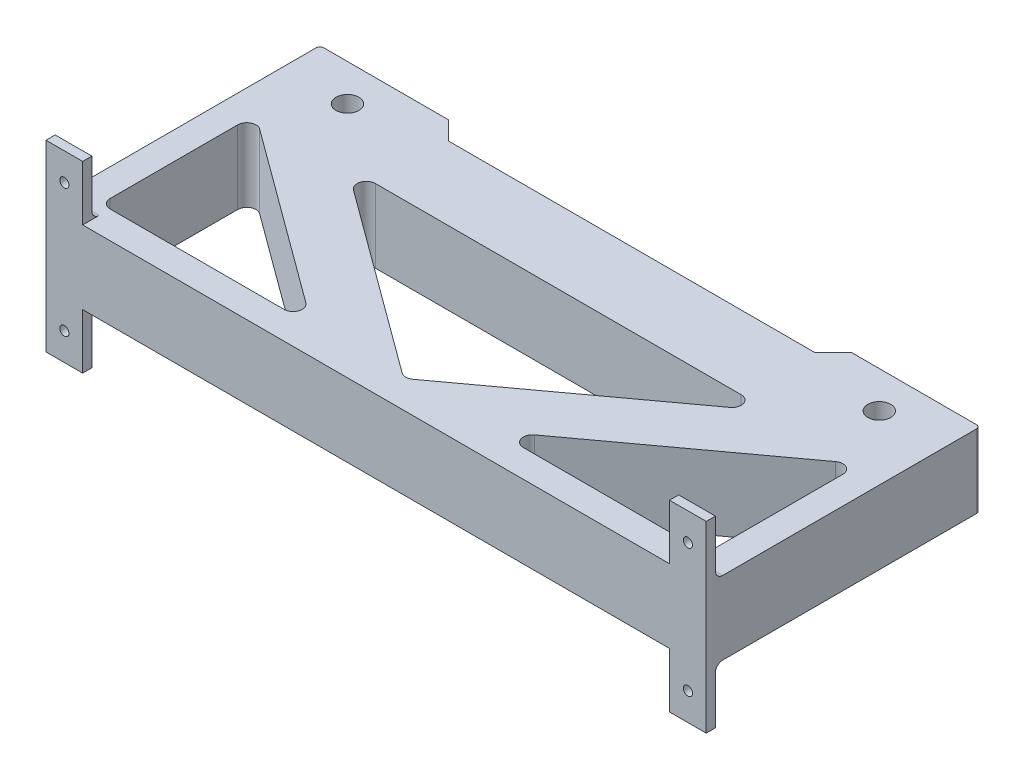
ISO-10303-21;
HEADER;
FILE_DESCRIPTION(('STEP AP214'),'2;1');
FILE_NAME('part.step','',(''),(''),'','','');
FILE_SCHEMA(('AUTOMOTIVE_DESIGN { 1 0 10303 214 1 1 1 1 }'));
ENDSEC;
DATA;
#1=APPLICATION_CONTEXT('core data for automotive mechanical design processes');
#2=APPLICATION_PROTOCOL_DEFINITION('international standard','automotive_design',2000,#1);
#3=PRODUCT_CONTEXT('',#1,'mechanical');
#4=PRODUCT('Part','Part','',(#3));
#5=PRODUCT_RELATED_PRODUCT_CATEGORY('part','',(#4));
#6=PRODUCT_DEFINITION_FORMATION('','',#4);
#7=PRODUCT_DEFINITION_CONTEXT('part definition',#1,'design');
#8=PRODUCT_DEFINITION('design','',#6,#7);
#9=PRODUCT_DEFINITION_SHAPE('','',#8);
#10=(LENGTH_UNIT() NAMED_UNIT(*) SI_UNIT(.MILLI.,.METRE.));
#11=(NAMED_UNIT(*) PLANE_ANGLE_UNIT() SI_UNIT($,.RADIAN.));
#12=(NAMED_UNIT(*) SI_UNIT($,.STERADIAN.) SOLID_ANGLE_UNIT());
#13=UNCERTAINTY_MEASURE_WITH_UNIT(LENGTH_MEASURE(1.E-05),#10,'distance_accuracy_value','');
#14=(GEOMETRIC_REPRESENTATION_CONTEXT(3) GLOBAL_UNCERTAINTY_ASSIGNED_CONTEXT((#13)) GLOBAL_UNIT_ASSIGNED_CONTEXT((#10,
#11,#12)) REPRESENTATION_CONTEXT('',''));
#15=CARTESIAN_POINT('',(0.,0.,0.));
#16=DIRECTION('',(0.,0.,1.));
#17=DIRECTION('',(1.,0.,0.));
#18=AXIS2_PLACEMENT_3D('',#15,#16,#17);
#19=CARTESIAN_POINT('',(-184.15,50.8,-69.4436));
#20=DIRECTION('',(0.,-1.,0.));
#21=DIRECTION('',(0.,0.,-1.));
#22=AXIS2_PLACEMENT_3D('',#19,#20,#21);
#23=CYLINDRICAL_SURFACE('',#22,7.93750000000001);
#24=CARTESIAN_POINT('',(-184.15,11.3284,-69.4436));
#25=DIRECTION('',(0.,-1.,0.));
#26=DIRECTION('',(0.,0.,-1.));
#27=AXIS2_PLACEMENT_3D('',#24,#25,#26);
#28=CIRCLE('',#27,7.93750000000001);
#29=CARTESIAN_POINT('',(-184.15,11.3284,-77.3811));
#30=VERTEX_POINT('',#29);
#31=EDGE_CURVE('E536',#30,#30,#28,.T.);
#32=ORIENTED_EDGE('',*,*,#31,.F.);
#33=EDGE_LOOP('',(#32));
#34=FACE_BOUND('',#33,.T.);
#35=CARTESIAN_POINT('',(-184.15,0.,-69.4436));
#36=DIRECTION('',(0.,1.,0.));
#37=DIRECTION('',(0.,0.,1.));
#38=AXIS2_PLACEMENT_3D('',#35,#36,#37);
#39=CIRCLE('',#38,7.93750000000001);
#40=CARTESIAN_POINT('',(-184.15,0.,-61.5061));
#41=VERTEX_POINT('',#40);
#42=EDGE_CURVE('E532',#41,#41,#39,.T.);
#43=ORIENTED_EDGE('',*,*,#42,.F.);
#44=EDGE_LOOP('',(#43));
#45=FACE_BOUND('',#44,.T.);
#46=ADVANCED_FACE('F33',(#34,#45),#23,.F.);
#47=CARTESIAN_POINT('',(184.15,50.8,-69.4436));
#48=DIRECTION('',(0.,-1.,0.));
#49=DIRECTION('',(0.,0.,-1.));
#50=AXIS2_PLACEMENT_3D('',#47,#48,#49);
#51=CYLINDRICAL_SURFACE('',#50,7.93749999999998);
#52=CARTESIAN_POINT('',(184.15,11.3284,-69.4436));
#53=DIRECTION('',(0.,-1.,0.));
#54=DIRECTION('',(0.,0.,-1.));
#55=AXIS2_PLACEMENT_3D('',#52,#53,#54);
#56=CIRCLE('',#55,7.93749999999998);
#57=CARTESIAN_POINT('',(184.15,11.3284,-77.3810999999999));
#58=VERTEX_POINT('',#57);
#59=EDGE_CURVE('E730',#58,#58,#56,.T.);
#60=ORIENTED_EDGE('',*,*,#59,.F.);
#61=EDGE_LOOP('',(#60));
#62=FACE_BOUND('',#61,.T.);
#63=CARTESIAN_POINT('',(184.15,0.,-69.4436));
#64=DIRECTION('',(0.,1.,0.));
#65=DIRECTION('',(0.,0.,1.));
#66=AXIS2_PLACEMENT_3D('',#63,#64,#65);
#67=CIRCLE('',#66,7.93749999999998);
#68=CARTESIAN_POINT('',(184.15,0.,-61.5061));
#69=VERTEX_POINT('',#68);
#70=EDGE_CURVE('E533',#69,#69,#67,.T.);
#71=ORIENTED_EDGE('',*,*,#70,.F.);
#72=EDGE_LOOP('',(#71));
#73=FACE_BOUND('',#72,.T.);
#74=ADVANCED_FACE('F846',(#62,#73),#51,.F.);
#75=CARTESIAN_POINT('',(0.,50.8,0.));
#76=DIRECTION('',(0.,-1.,0.));
#77=DIRECTION('',(0.,0.,-1.));
#78=AXIS2_PLACEMENT_3D('',#75,#76,#77);
#79=PLANE('',#78);
#80=DIRECTION('',(-0.806315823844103,0.,-0.591485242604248));
#81=VECTOR('',#80,1.);
#82=CARTESIAN_POINT('',(-63.5,50.8,75.7936));
#83=LINE('',#82,#81);
#84=CARTESIAN_POINT('',(-79.136108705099,50.8,64.32349451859));
#85=VERTEX_POINT('',#84);
#86=CARTESIAN_POINT('',(-199.444068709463,50.8,-23.9302403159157));
#87=VERTEX_POINT('',#86);
#88=EDGE_CURVE('E561',#85,#87,#83,.T.);
#89=ORIENTED_EDGE('',*,*,#88,.F.);
#90=CARTESIAN_POINT('',(-82.892039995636,50.8,69.4436));
#91=DIRECTION('',(0.,-1.,0.));
#92=DIRECTION('',(0.,0.,-1.));
#93=AXIS2_PLACEMENT_3D('',#90,#91,#92);
#94=CIRCLE('',#93,6.35);
#95=CARTESIAN_POINT('',(-82.892039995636,50.8,75.7936));
#96=VERTEX_POINT('',#95);
#97=EDGE_CURVE('E705',#85,#96,#94,.T.);
#98=ORIENTED_EDGE('',*,*,#97,.T.);
#99=DIRECTION('',(1.,0.,0.));
#100=VECTOR('',#99,1.);
#101=CARTESIAN_POINT('',(-209.55,50.8,75.7936));
#102=LINE('',#101,#100);
#103=CARTESIAN_POINT('',(-203.2,50.8,75.7936));
#104=VERTEX_POINT('',#103);
#105=EDGE_CURVE('E568',#104,#96,#102,.T.);
#106=ORIENTED_EDGE('',*,*,#105,.F.);
#107=CARTESIAN_POINT('',(-203.2,50.8,69.4436));
#108=DIRECTION('',(0.,-1.,0.));
#109=DIRECTION('',(0.,0.,-1.));
#110=AXIS2_PLACEMENT_3D('',#107,#108,#109);
#111=CIRCLE('',#110,6.35);
#112=CARTESIAN_POINT('',(-209.55,50.8,69.4436));
#113=VERTEX_POINT('',#112);
#114=EDGE_CURVE('E713',#104,#113,#111,.T.);
#115=ORIENTED_EDGE('',*,*,#114,.T.);
#116=DIRECTION('',(0.,0.,1.));
#117=VECTOR('',#116,1.);
#118=CARTESIAN_POINT('',(-209.55,50.8,-31.3436));
#119=LINE('',#118,#117);
#120=CARTESIAN_POINT('',(-209.55,50.8,-18.8101348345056));
#121=VERTEX_POINT('',#120);
#122=EDGE_CURVE('E564',#121,#113,#119,.T.);
#123=ORIENTED_EDGE('',*,*,#122,.F.);
#124=CARTESIAN_POINT('',(-203.2,50.8,-18.8101348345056));
#125=DIRECTION('',(0.,-1.,0.));
#126=DIRECTION('',(0.,0.,-1.));
#127=AXIS2_PLACEMENT_3D('',#124,#125,#126);
#128=CIRCLE('',#127,6.35);
#129=EDGE_CURVE('E709',#121,#87,#128,.T.);
#130=ORIENTED_EDGE('',*,*,#129,.T.);
#131=EDGE_LOOP('',(#89,#98,#106,#115,#123,#130));
#132=FACE_BOUND('',#131,.T.);
#133=DIRECTION('',(0.,0.,-1.));
#134=VECTOR('',#133,1.);
#135=CARTESIAN_POINT('',(228.6,50.8,94.8435999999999));
#136=LINE('',#135,#134);
#137=CARTESIAN_POINT('',(228.6,50.8,83.4135999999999));
#138=VERTEX_POINT('',#137);
#139=CARTESIAN_POINT('',(228.6,50.8,-92.3036000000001));
#140=VERTEX_POINT('',#139);
#141=EDGE_CURVE('E604',#138,#140,#136,.T.);
#142=ORIENTED_EDGE('',*,*,#141,.T.);
#143=CARTESIAN_POINT('',(226.06,50.8,-92.3036000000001));
#144=DIRECTION('',(0.,-1.,0.));
#145=DIRECTION('',(0.,0.,-1.));
#146=AXIS2_PLACEMENT_3D('',#143,#144,#145);
#147=CIRCLE('',#146,2.54);
#148=CARTESIAN_POINT('',(226.06,50.8,-94.8436000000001));
#149=VERTEX_POINT('',#148);
#150=EDGE_CURVE('E798',#140,#149,#147,.F.);
#151=ORIENTED_EDGE('',*,*,#150,.T.);
#152=DIRECTION('',(-1.,0.,0.));
#153=VECTOR('',#152,1.);
#154=CARTESIAN_POINT('',(228.6,50.8,-94.8436000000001));
#155=LINE('',#154,#153);
#156=CARTESIAN_POINT('',(139.7,50.8,-94.8436000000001));
#157=VERTEX_POINT('',#156);
#158=EDGE_CURVE('E607',#149,#157,#155,.T.);
#159=ORIENTED_EDGE('',*,*,#158,.T.);
#160=DIRECTION('',(-0.707106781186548,0.,0.707106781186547));
#161=VECTOR('',#160,1.);
#162=CARTESIAN_POINT('',(127.,50.8,-82.1436000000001));
#163=LINE('',#162,#161);
#164=CARTESIAN_POINT('',(127.,50.8,-82.1436000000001));
#165=VERTEX_POINT('',#164);
#166=EDGE_CURVE('E609',#157,#165,#163,.T.);
#167=ORIENTED_EDGE('',*,*,#166,.T.);
#168=DIRECTION('',(-1.,0.,0.));
#169=VECTOR('',#168,1.);
#170=CARTESIAN_POINT('',(-127.,50.8,-82.1436000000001));
#171=LINE('',#170,#169);
#172=CARTESIAN_POINT('',(-127.,50.8,-82.1436000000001));
#173=VERTEX_POINT('',#172);
#174=EDGE_CURVE('E611',#165,#173,#171,.T.);
#175=ORIENTED_EDGE('',*,*,#174,.T.);
#176=DIRECTION('',(-0.70710678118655,0.,-0.707106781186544));
#177=VECTOR('',#176,1.);
#178=CARTESIAN_POINT('',(-139.7,50.8,-94.8435999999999));
#179=LINE('',#178,#177);
#180=CARTESIAN_POINT('',(-139.7,50.8,-94.8435999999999));
#181=VERTEX_POINT('',#180);
#182=EDGE_CURVE('E613',#173,#181,#179,.T.);
#183=ORIENTED_EDGE('',*,*,#182,.T.);
#184=DIRECTION('',(-1.,0.,0.));
#185=VECTOR('',#184,1.);
#186=CARTESIAN_POINT('',(-139.7,50.8,-94.8435999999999));
#187=LINE('',#186,#185);
#188=CARTESIAN_POINT('',(-226.06,50.8,-94.8436));
#189=VERTEX_POINT('',#188);
#190=EDGE_CURVE('E597',#181,#189,#187,.T.);
#191=ORIENTED_EDGE('',*,*,#190,.T.);
#192=CARTESIAN_POINT('',(-226.06,50.8,-92.3036));
#193=DIRECTION('',(0.,-1.,0.));
#194=DIRECTION('',(0.,0.,-1.));
#195=AXIS2_PLACEMENT_3D('',#192,#193,#194);
#196=CIRCLE('',#195,2.54);
#197=CARTESIAN_POINT('',(-228.6,50.8,-92.3035999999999));
#198=VERTEX_POINT('',#197);
#199=EDGE_CURVE('E48',#189,#198,#196,.F.);
#200=ORIENTED_EDGE('',*,*,#199,.T.);
#201=DIRECTION('',(0.,0.,1.));
#202=VECTOR('',#201,1.);
#203=CARTESIAN_POINT('',(-228.6,50.8,94.8436));
#204=LINE('',#203,#202);
#205=CARTESIAN_POINT('',(-228.6,50.8,83.4135999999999));
#206=VERTEX_POINT('',#205);
#207=EDGE_CURVE('E599',#198,#206,#204,.T.);
#208=ORIENTED_EDGE('',*,*,#207,.T.);
#209=DIRECTION('',(-1.,0.,0.));
#210=VECTOR('',#209,1.);
#211=CARTESIAN_POINT('',(0.,50.8,83.4135999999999));
#212=LINE('',#211,#210);
#213=CARTESIAN_POINT('',(-203.2,50.8,83.4135999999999));
#214=VERTEX_POINT('',#213);
#215=EDGE_CURVE('E727',#206,#214,#212,.F.);
#216=ORIENTED_EDGE('',*,*,#215,.T.);
#217=DIRECTION('',(0.,0.,1.));
#218=VECTOR('',#217,1.);
#219=CARTESIAN_POINT('',(-203.2,50.8,94.8436));
#220=LINE('',#219,#218);
#221=CARTESIAN_POINT('',(-203.2,50.8,94.8436));
#222=VERTEX_POINT('',#221);
#223=EDGE_CURVE('E408',#214,#222,#220,.T.);
#224=ORIENTED_EDGE('',*,*,#223,.T.);
#225=DIRECTION('',(1.,0.,0.));
#226=VECTOR('',#225,1.);
#227=CARTESIAN_POINT('',(228.6,50.8,94.8435999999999));
#228=LINE('',#227,#226);
#229=CARTESIAN_POINT('',(203.2,50.8,94.8435999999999));
#230=VERTEX_POINT('',#229);
#231=EDGE_CURVE('E602',#222,#230,#228,.T.);
#232=ORIENTED_EDGE('',*,*,#231,.T.);
#233=DIRECTION('',(0.,0.,-1.));
#234=VECTOR('',#233,1.);
#235=CARTESIAN_POINT('',(203.2,50.8,88.4935999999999));
#236=LINE('',#235,#234);
#237=CARTESIAN_POINT('',(203.2,50.8,83.4135999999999));
#238=VERTEX_POINT('',#237);
#239=EDGE_CURVE('E453',#230,#238,#236,.T.);
#240=ORIENTED_EDGE('',*,*,#239,.T.);
#241=DIRECTION('',(1.,0.,0.));
#242=VECTOR('',#241,1.);
#243=CARTESIAN_POINT('',(0.,50.8,83.4135999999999));
#244=LINE('',#243,#242);
#245=EDGE_CURVE('E740',#238,#138,#244,.T.);
#246=ORIENTED_EDGE('',*,*,#245,.T.);
#247=EDGE_LOOP('',(#142,#151,#159,#167,#175,#183,#191,#200,#208,#216,#224,#232,#240,#246));
#248=FACE_BOUND('',#247,.T.);
#249=DIRECTION('',(0.806315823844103,0.,0.591485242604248));
#250=VECTOR('',#249,1.);
#251=CARTESIAN_POINT('',(-146.05,50.8,-31.3436));
#252=LINE('',#251,#250);
#253=CARTESIAN_POINT('',(-130.413891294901,50.8,-19.87349451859));
#254=VERTEX_POINT('',#253);
#255=CARTESIAN_POINT('',(-3.75593129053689,50.8,73.0383794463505));
#256=VERTEX_POINT('',#255);
#257=EDGE_CURVE('E579',#254,#256,#252,.T.);
#258=ORIENTED_EDGE('',*,*,#257,.F.);
#259=CARTESIAN_POINT('',(-126.657960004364,50.8,-24.9936));
#260=DIRECTION('',(0.,-1.,0.));
#261=DIRECTION('',(0.,0.,-1.));
#262=AXIS2_PLACEMENT_3D('',#259,#260,#261);
#263=CIRCLE('',#262,6.35);
#264=CARTESIAN_POINT('',(-126.657960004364,50.8,-31.3436));
#265=VERTEX_POINT('',#264);
#266=EDGE_CURVE('E725',#254,#265,#263,.T.);
#267=ORIENTED_EDGE('',*,*,#266,.T.);
#268=DIRECTION('',(-1.,0.,0.));
#269=VECTOR('',#268,1.);
#270=CARTESIAN_POINT('',(146.05,50.8,-31.3436000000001));
#271=LINE('',#270,#269);
#272=CARTESIAN_POINT('',(126.657960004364,50.8,-31.3436000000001));
#273=VERTEX_POINT('',#272);
#274=EDGE_CURVE('E586',#273,#265,#271,.T.);
#275=ORIENTED_EDGE('',*,*,#274,.F.);
#276=CARTESIAN_POINT('',(126.657960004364,50.8,-24.9936000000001));
#277=DIRECTION('',(0.,-1.,0.));
#278=DIRECTION('',(0.,0.,-1.));
#279=AXIS2_PLACEMENT_3D('',#276,#277,#278);
#280=CIRCLE('',#279,6.35);
#281=CARTESIAN_POINT('',(130.413891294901,50.8,-19.87349451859));
#282=VERTEX_POINT('',#281);
#283=EDGE_CURVE('E717',#273,#282,#280,.T.);
#284=ORIENTED_EDGE('',*,*,#283,.T.);
#285=DIRECTION('',(0.806315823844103,0.,-0.591485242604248));
#286=VECTOR('',#285,1.);
#287=CARTESIAN_POINT('',(146.05,50.8,-31.3436000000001));
#288=LINE('',#287,#286);
#289=CARTESIAN_POINT('',(3.75593129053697,50.8,73.0383794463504));
#290=VERTEX_POINT('',#289);
#291=EDGE_CURVE('E582',#290,#282,#288,.T.);
#292=ORIENTED_EDGE('',*,*,#291,.F.);
#293=CARTESIAN_POINT('',(0.,50.8,67.9182739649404));
#294=DIRECTION('',(0.,-1.,0.));
#295=DIRECTION('',(0.,0.,-1.));
#296=AXIS2_PLACEMENT_3D('',#293,#294,#295);
#297=CIRCLE('',#296,6.35);
#298=EDGE_CURVE('E721',#290,#256,#297,.T.);
#299=ORIENTED_EDGE('',*,*,#298,.T.);
#300=EDGE_LOOP('',(#258,#267,#275,#284,#292,#299));
#301=FACE_BOUND('',#300,.T.);
#302=DIRECTION('',(0.,0.,-1.));
#303=VECTOR('',#302,1.);
#304=CARTESIAN_POINT('',(209.55,50.8,-31.3436000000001));
#305=LINE('',#304,#303);
#306=CARTESIAN_POINT('',(209.55,50.8,69.4435999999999));
#307=VERTEX_POINT('',#306);
#308=CARTESIAN_POINT('',(209.55,50.8,-18.8101348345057));
#309=VERTEX_POINT('',#308);
#310=EDGE_CURVE('E543',#307,#309,#305,.T.);
#311=ORIENTED_EDGE('',*,*,#310,.F.);
#312=CARTESIAN_POINT('',(203.2,50.8,69.4435999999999));
#313=DIRECTION('',(0.,-1.,0.));
#314=DIRECTION('',(0.,0.,-1.));
#315=AXIS2_PLACEMENT_3D('',#312,#313,#314);
#316=CIRCLE('',#315,6.35);
#317=CARTESIAN_POINT('',(203.2,50.8,75.7935999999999));
#318=VERTEX_POINT('',#317);
#319=EDGE_CURVE('E701',#307,#318,#316,.T.);
#320=ORIENTED_EDGE('',*,*,#319,.T.);
#321=DIRECTION('',(1.,0.,0.));
#322=VECTOR('',#321,1.);
#323=CARTESIAN_POINT('',(209.55,50.8,75.7935999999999));
#324=LINE('',#323,#322);
#325=CARTESIAN_POINT('',(82.8920399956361,50.8,75.7935999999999));
#326=VERTEX_POINT('',#325);
#327=EDGE_CURVE('E550',#326,#318,#324,.T.);
#328=ORIENTED_EDGE('',*,*,#327,.F.);
#329=CARTESIAN_POINT('',(82.8920399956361,50.8,69.4435999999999));
#330=DIRECTION('',(0.,-1.,0.));
#331=DIRECTION('',(0.,0.,-1.));
#332=AXIS2_PLACEMENT_3D('',#329,#330,#331);
#333=CIRCLE('',#332,6.35);
#334=CARTESIAN_POINT('',(79.1361087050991,50.8,64.3234945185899));
#335=VERTEX_POINT('',#334);
#336=EDGE_CURVE('E693',#326,#335,#333,.T.);
#337=ORIENTED_EDGE('',*,*,#336,.T.);
#338=DIRECTION('',(-0.806315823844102,0.,0.591485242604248));
#339=VECTOR('',#338,1.);
#340=CARTESIAN_POINT('',(63.5000000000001,50.8,75.7935999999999));
#341=LINE('',#340,#339);
#342=CARTESIAN_POINT('',(199.444068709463,50.8,-23.9302403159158));
#343=VERTEX_POINT('',#342);
#344=EDGE_CURVE('E546',#343,#335,#341,.T.);
#345=ORIENTED_EDGE('',*,*,#344,.F.);
#346=CARTESIAN_POINT('',(203.2,50.8,-18.8101348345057));
#347=DIRECTION('',(0.,-1.,0.));
#348=DIRECTION('',(0.,0.,-1.));
#349=AXIS2_PLACEMENT_3D('',#346,#347,#348);
#350=CIRCLE('',#349,6.35);
#351=EDGE_CURVE('E697',#343,#309,#350,.T.);
#352=ORIENTED_EDGE('',*,*,#351,.T.);
#353=EDGE_LOOP('',(#311,#320,#328,#337,#345,#352));
#354=FACE_BOUND('',#353,.T.);
#355=CARTESIAN_POINT('',(-184.15,50.8,-69.4436));
#356=DIRECTION('',(0.,1.,0.));
#357=DIRECTION('',(0.,0.,1.));
#358=AXIS2_PLACEMENT_3D('',#355,#356,#357);
#359=CIRCLE('',#358,7.93750000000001);
#360=CARTESIAN_POINT('',(-184.15,50.8,-61.5061));
#361=VERTEX_POINT('',#360);
#362=EDGE_CURVE('E537',#361,#361,#359,.T.);
#363=ORIENTED_EDGE('',*,*,#362,.F.);
#364=EDGE_LOOP('',(#363));
#365=FACE_BOUND('',#364,.T.);
#366=CARTESIAN_POINT('',(184.15,50.8,-69.4436));
#367=DIRECTION('',(0.,1.,0.));
#368=DIRECTION('',(0.,0.,1.));
#369=AXIS2_PLACEMENT_3D('',#366,#367,#368);
#370=CIRCLE('',#369,7.93749999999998);
#371=CARTESIAN_POINT('',(184.15,50.8,-61.5061));
#372=VERTEX_POINT('',#371);
#373=EDGE_CURVE('E529',#372,#372,#370,.T.);
#374=ORIENTED_EDGE('',*,*,#373,.F.);
#375=EDGE_LOOP('',(#374));
#376=FACE_BOUND('',#375,.T.);
#377=ADVANCED_FACE('F831',(#132,#248,#301,#354,#365,#376),#79,.F.);
#378=CARTESIAN_POINT('',(0.,0.,0.));
#379=DIRECTION('',(0.,-1.,0.));
#380=DIRECTION('',(0.,0.,-1.));
#381=AXIS2_PLACEMENT_3D('',#378,#379,#380);
#382=PLANE('',#381);
#383=DIRECTION('',(-1.,0.,0.));
#384=VECTOR('',#383,1.);
#385=CARTESIAN_POINT('',(228.6,0.,-94.8436000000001));
#386=LINE('',#385,#384);
#387=CARTESIAN_POINT('',(226.06,0.,-94.8436000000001));
#388=VERTEX_POINT('',#387);
#389=CARTESIAN_POINT('',(139.7,0.,-94.8436000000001));
#390=VERTEX_POINT('',#389);
#391=EDGE_CURVE('E624',#388,#390,#386,.T.);
#392=ORIENTED_EDGE('',*,*,#391,.F.);
#393=CARTESIAN_POINT('',(226.06,0.,-92.3036000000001));
#394=DIRECTION('',(0.,-1.,0.));
#395=DIRECTION('',(0.,0.,-1.));
#396=AXIS2_PLACEMENT_3D('',#393,#394,#395);
#397=CIRCLE('',#396,2.54);
#398=CARTESIAN_POINT('',(228.6,0.,-92.3036000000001));
#399=VERTEX_POINT('',#398);
#400=EDGE_CURVE('E793',#388,#399,#397,.T.);
#401=ORIENTED_EDGE('',*,*,#400,.T.);
#402=DIRECTION('',(0.,0.,-1.));
#403=VECTOR('',#402,1.);
#404=CARTESIAN_POINT('',(228.6,0.,94.8435999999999));
#405=LINE('',#404,#403);
#406=CARTESIAN_POINT('',(228.6,0.,83.4135999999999));
#407=VERTEX_POINT('',#406);
#408=EDGE_CURVE('E621',#407,#399,#405,.T.);
#409=ORIENTED_EDGE('',*,*,#408,.F.);
#410=DIRECTION('',(1.,0.,0.));
#411=VECTOR('',#410,1.);
#412=CARTESIAN_POINT('',(203.2,0.,83.4135999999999));
#413=LINE('',#412,#411);
#414=CARTESIAN_POINT('',(203.2,0.,83.4135999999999));
#415=VERTEX_POINT('',#414);
#416=EDGE_CURVE('E754',#407,#415,#413,.F.);
#417=ORIENTED_EDGE('',*,*,#416,.T.);
#418=DIRECTION('',(0.,0.,1.));
#419=VECTOR('',#418,1.);
#420=CARTESIAN_POINT('',(203.2,0.,94.8435999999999));
#421=LINE('',#420,#419);
#422=CARTESIAN_POINT('',(203.2,0.,94.8435999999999));
#423=VERTEX_POINT('',#422);
#424=EDGE_CURVE('E431',#415,#423,#421,.T.);
#425=ORIENTED_EDGE('',*,*,#424,.T.);
#426=DIRECTION('',(1.,0.,0.));
#427=VECTOR('',#426,1.);
#428=CARTESIAN_POINT('',(228.6,0.,94.8435999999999));
#429=LINE('',#428,#427);
#430=CARTESIAN_POINT('',(-203.2,0.,94.8436));
#431=VERTEX_POINT('',#430);
#432=EDGE_CURVE('E619',#431,#423,#429,.T.);
#433=ORIENTED_EDGE('',*,*,#432,.F.);
#434=DIRECTION('',(0.,0.,-1.));
#435=VECTOR('',#434,1.);
#436=CARTESIAN_POINT('',(-203.2,0.,94.8436));
#437=LINE('',#436,#435);
#438=CARTESIAN_POINT('',(-203.2,0.,83.4135999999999));
#439=VERTEX_POINT('',#438);
#440=EDGE_CURVE('E375',#431,#439,#437,.T.);
#441=ORIENTED_EDGE('',*,*,#440,.T.);
#442=DIRECTION('',(-1.,0.,0.));
#443=VECTOR('',#442,1.);
#444=CARTESIAN_POINT('',(-228.6,0.,83.4135999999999));
#445=LINE('',#444,#443);
#446=CARTESIAN_POINT('',(-228.6,0.,83.4135999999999));
#447=VERTEX_POINT('',#446);
#448=EDGE_CURVE('E751',#439,#447,#445,.T.);
#449=ORIENTED_EDGE('',*,*,#448,.T.);
#450=DIRECTION('',(0.,0.,1.));
#451=VECTOR('',#450,1.);
#452=CARTESIAN_POINT('',(-228.6,0.,94.8436));
#453=LINE('',#452,#451);
#454=CARTESIAN_POINT('',(-228.6,0.,-92.3035999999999));
#455=VERTEX_POINT('',#454);
#456=EDGE_CURVE('E617',#455,#447,#453,.T.);
#457=ORIENTED_EDGE('',*,*,#456,.F.);
#458=CARTESIAN_POINT('',(-226.06,0.,-92.3036));
#459=DIRECTION('',(0.,-1.,0.));
#460=DIRECTION('',(0.,0.,-1.));
#461=AXIS2_PLACEMENT_3D('',#458,#459,#460);
#462=CIRCLE('',#461,2.54);
#463=CARTESIAN_POINT('',(-226.06,0.,-94.8436));
#464=VERTEX_POINT('',#463);
#465=EDGE_CURVE('E791',#455,#464,#462,.T.);
#466=ORIENTED_EDGE('',*,*,#465,.T.);
#467=DIRECTION('',(-1.,0.,0.));
#468=VECTOR('',#467,1.);
#469=CARTESIAN_POINT('',(-139.7,0.,-94.8435999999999));
#470=LINE('',#469,#468);
#471=CARTESIAN_POINT('',(-139.7,0.,-94.8435999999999));
#472=VERTEX_POINT('',#471);
#473=EDGE_CURVE('E589',#472,#464,#470,.T.);
#474=ORIENTED_EDGE('',*,*,#473,.F.);
#475=DIRECTION('',(-0.70710678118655,0.,-0.707106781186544));
#476=VECTOR('',#475,1.);
#477=CARTESIAN_POINT('',(-139.7,0.,-94.8435999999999));
#478=LINE('',#477,#476);
#479=CARTESIAN_POINT('',(-127.,0.,-82.1436000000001));
#480=VERTEX_POINT('',#479);
#481=EDGE_CURVE('E600',#480,#472,#478,.T.);
#482=ORIENTED_EDGE('',*,*,#481,.F.);
#483=DIRECTION('',(-1.,0.,0.));
#484=VECTOR('',#483,1.);
#485=CARTESIAN_POINT('',(-127.,0.,-82.1436000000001));
#486=LINE('',#485,#484);
#487=CARTESIAN_POINT('',(127.,0.,-82.1436000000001));
#488=VERTEX_POINT('',#487);
#489=EDGE_CURVE('E628',#488,#480,#486,.T.);
#490=ORIENTED_EDGE('',*,*,#489,.F.);
#491=DIRECTION('',(-0.707106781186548,0.,0.707106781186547));
#492=VECTOR('',#491,1.);
#493=CARTESIAN_POINT('',(127.,0.,-82.1436000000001));
#494=LINE('',#493,#492);
#495=EDGE_CURVE('E626',#390,#488,#494,.T.);
#496=ORIENTED_EDGE('',*,*,#495,.F.);
#497=EDGE_LOOP('',(#392,#401,#409,#417,#425,#433,#441,#449,#457,#466,#474,#482,#490,#496));
#498=FACE_BOUND('',#497,.T.);
#499=ORIENTED_EDGE('',*,*,#42,.T.);
#500=EDGE_LOOP('',(#499));
#501=FACE_BOUND('',#500,.T.);
#502=DIRECTION('',(0.806315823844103,0.,-0.591485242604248));
#503=VECTOR('',#502,1.);
#504=CARTESIAN_POINT('',(146.05,0.,-31.3436000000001));
#505=LINE('',#504,#503);
#506=CARTESIAN_POINT('',(3.75593129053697,0.,73.0383794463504));
#507=VERTEX_POINT('',#506);
#508=CARTESIAN_POINT('',(130.413891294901,0.,-19.87349451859));
#509=VERTEX_POINT('',#508);
#510=EDGE_CURVE('E592',#507,#509,#505,.T.);
#511=ORIENTED_EDGE('',*,*,#510,.T.);
#512=CARTESIAN_POINT('',(126.657960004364,0.,-24.9936000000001));
#513=DIRECTION('',(0.,-1.,0.));
#514=DIRECTION('',(0.,0.,-1.));
#515=AXIS2_PLACEMENT_3D('',#512,#513,#514);
#516=CIRCLE('',#515,6.35);
#517=CARTESIAN_POINT('',(126.657960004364,0.,-31.3436000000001));
#518=VERTEX_POINT('',#517);
#519=EDGE_CURVE('E715',#509,#518,#516,.F.);
#520=ORIENTED_EDGE('',*,*,#519,.T.);
#521=DIRECTION('',(-1.,0.,0.));
#522=VECTOR('',#521,1.);
#523=CARTESIAN_POINT('',(146.05,0.,-31.3436000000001));
#524=LINE('',#523,#522);
#525=CARTESIAN_POINT('',(-126.657960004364,0.,-31.3436));
#526=VERTEX_POINT('',#525);
#527=EDGE_CURVE('E583',#518,#526,#524,.T.);
#528=ORIENTED_EDGE('',*,*,#527,.T.);
#529=CARTESIAN_POINT('',(-126.657960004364,0.,-24.9936));
#530=DIRECTION('',(0.,-1.,0.));
#531=DIRECTION('',(0.,0.,-1.));
#532=AXIS2_PLACEMENT_3D('',#529,#530,#531);
#533=CIRCLE('',#532,6.35);
#534=CARTESIAN_POINT('',(-130.413891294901,0.,-19.87349451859));
#535=VERTEX_POINT('',#534);
#536=EDGE_CURVE('E723',#526,#535,#533,.F.);
#537=ORIENTED_EDGE('',*,*,#536,.T.);
#538=DIRECTION('',(0.806315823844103,0.,0.591485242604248));
#539=VECTOR('',#538,1.);
#540=CARTESIAN_POINT('',(-146.05,0.,-31.3436));
#541=LINE('',#540,#539);
#542=CARTESIAN_POINT('',(-3.75593129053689,0.,73.0383794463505));
#543=VERTEX_POINT('',#542);
#544=EDGE_CURVE('E571',#535,#543,#541,.T.);
#545=ORIENTED_EDGE('',*,*,#544,.T.);
#546=CARTESIAN_POINT('',(0.,0.,67.9182739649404));
#547=DIRECTION('',(0.,-1.,0.));
#548=DIRECTION('',(0.,0.,-1.));
#549=AXIS2_PLACEMENT_3D('',#546,#547,#548);
#550=CIRCLE('',#549,6.35);
#551=EDGE_CURVE('E719',#543,#507,#550,.F.);
#552=ORIENTED_EDGE('',*,*,#551,.T.);
#553=EDGE_LOOP('',(#511,#520,#528,#537,#545,#552));
#554=FACE_BOUND('',#553,.T.);
#555=DIRECTION('',(0.,0.,1.));
#556=VECTOR('',#555,1.);
#557=CARTESIAN_POINT('',(-209.55,0.,-31.3436));
#558=LINE('',#557,#556);
#559=CARTESIAN_POINT('',(-209.55,0.,-18.8101348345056));
#560=VERTEX_POINT('',#559);
#561=CARTESIAN_POINT('',(-209.55,0.,69.4436));
#562=VERTEX_POINT('',#561);
#563=EDGE_CURVE('E574',#560,#562,#558,.T.);
#564=ORIENTED_EDGE('',*,*,#563,.T.);
#565=CARTESIAN_POINT('',(-203.2,0.,69.4436));
#566=DIRECTION('',(0.,-1.,0.));
#567=DIRECTION('',(0.,0.,-1.));
#568=AXIS2_PLACEMENT_3D('',#565,#566,#567);
#569=CIRCLE('',#568,6.35);
#570=CARTESIAN_POINT('',(-203.2,0.,75.7936));
#571=VERTEX_POINT('',#570);
#572=EDGE_CURVE('E711',#562,#571,#569,.F.);
#573=ORIENTED_EDGE('',*,*,#572,.T.);
#574=DIRECTION('',(1.,0.,0.));
#575=VECTOR('',#574,1.);
#576=CARTESIAN_POINT('',(-209.55,0.,75.7936));
#577=LINE('',#576,#575);
#578=CARTESIAN_POINT('',(-82.892039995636,0.,75.7936));
#579=VERTEX_POINT('',#578);
#580=EDGE_CURVE('E565',#571,#579,#577,.T.);
#581=ORIENTED_EDGE('',*,*,#580,.T.);
#582=CARTESIAN_POINT('',(-82.892039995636,0.,69.4436));
#583=DIRECTION('',(0.,-1.,0.));
#584=DIRECTION('',(0.,0.,-1.));
#585=AXIS2_PLACEMENT_3D('',#582,#583,#584);
#586=CIRCLE('',#585,6.35);
#587=CARTESIAN_POINT('',(-79.136108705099,0.,64.32349451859));
#588=VERTEX_POINT('',#587);
#589=EDGE_CURVE('E703',#579,#588,#586,.F.);
#590=ORIENTED_EDGE('',*,*,#589,.T.);
#591=DIRECTION('',(-0.806315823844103,0.,-0.591485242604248));
#592=VECTOR('',#591,1.);
#593=CARTESIAN_POINT('',(-63.5,0.,75.7936));
#594=LINE('',#593,#592);
#595=CARTESIAN_POINT('',(-199.444068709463,0.,-23.9302403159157));
#596=VERTEX_POINT('',#595);
#597=EDGE_CURVE('E553',#588,#596,#594,.T.);
#598=ORIENTED_EDGE('',*,*,#597,.T.);
#599=CARTESIAN_POINT('',(-203.2,0.,-18.8101348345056));
#600=DIRECTION('',(0.,-1.,0.));
#601=DIRECTION('',(0.,0.,-1.));
#602=AXIS2_PLACEMENT_3D('',#599,#600,#601);
#603=CIRCLE('',#602,6.35);
#604=EDGE_CURVE('E707',#596,#560,#603,.F.);
#605=ORIENTED_EDGE('',*,*,#604,.T.);
#606=EDGE_LOOP('',(#564,#573,#581,#590,#598,#605));
#607=FACE_BOUND('',#606,.T.);
#608=DIRECTION('',(-0.806315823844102,0.,0.591485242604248));
#609=VECTOR('',#608,1.);
#610=CARTESIAN_POINT('',(63.5000000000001,0.,75.7935999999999));
#611=LINE('',#610,#609);
#612=CARTESIAN_POINT('',(199.444068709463,0.,-23.9302403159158));
#613=VERTEX_POINT('',#612);
#614=CARTESIAN_POINT('',(79.1361087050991,0.,64.3234945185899));
#615=VERTEX_POINT('',#614);
#616=EDGE_CURVE('E556',#613,#615,#611,.T.);
#617=ORIENTED_EDGE('',*,*,#616,.T.);
#618=CARTESIAN_POINT('',(82.8920399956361,0.,69.4435999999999));
#619=DIRECTION('',(0.,-1.,0.));
#620=DIRECTION('',(0.,0.,-1.));
#621=AXIS2_PLACEMENT_3D('',#618,#619,#620);
#622=CIRCLE('',#621,6.35);
#623=CARTESIAN_POINT('',(82.8920399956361,0.,75.7935999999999));
#624=VERTEX_POINT('',#623);
#625=EDGE_CURVE('E691',#615,#624,#622,.F.);
#626=ORIENTED_EDGE('',*,*,#625,.T.);
#627=DIRECTION('',(1.,0.,0.));
#628=VECTOR('',#627,1.);
#629=CARTESIAN_POINT('',(209.55,0.,75.7935999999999));
#630=LINE('',#629,#628);
#631=CARTESIAN_POINT('',(203.2,0.,75.7935999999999));
#632=VERTEX_POINT('',#631);
#633=EDGE_CURVE('E547',#624,#632,#630,.T.);
#634=ORIENTED_EDGE('',*,*,#633,.T.);
#635=CARTESIAN_POINT('',(203.2,0.,69.4435999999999));
#636=DIRECTION('',(0.,-1.,0.));
#637=DIRECTION('',(0.,0.,-1.));
#638=AXIS2_PLACEMENT_3D('',#635,#636,#637);
#639=CIRCLE('',#638,6.35);
#640=CARTESIAN_POINT('',(209.55,0.,69.4435999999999));
#641=VERTEX_POINT('',#640);
#642=EDGE_CURVE('E699',#632,#641,#639,.F.);
#643=ORIENTED_EDGE('',*,*,#642,.T.);
#644=DIRECTION('',(0.,0.,-1.));
#645=VECTOR('',#644,1.);
#646=CARTESIAN_POINT('',(209.55,0.,-31.3436000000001));
#647=LINE('',#646,#645);
#648=CARTESIAN_POINT('',(209.55,0.,-18.8101348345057));
#649=VERTEX_POINT('',#648);
#650=EDGE_CURVE('E540',#641,#649,#647,.T.);
#651=ORIENTED_EDGE('',*,*,#650,.T.);
#652=CARTESIAN_POINT('',(203.2,0.,-18.8101348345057));
#653=DIRECTION('',(0.,-1.,0.));
#654=DIRECTION('',(0.,0.,-1.));
#655=AXIS2_PLACEMENT_3D('',#652,#653,#654);
#656=CIRCLE('',#655,6.35);
#657=EDGE_CURVE('E695',#649,#613,#656,.F.);
#658=ORIENTED_EDGE('',*,*,#657,.T.);
#659=EDGE_LOOP('',(#617,#626,#634,#643,#651,#658));
#660=FACE_BOUND('',#659,.T.);
#661=ORIENTED_EDGE('',*,*,#70,.T.);
#662=EDGE_LOOP('',(#661));
#663=FACE_BOUND('',#662,.T.);
#664=ADVANCED_FACE('F808',(#498,#501,#554,#607,#660,#663),#382,.T.);
#665=CARTESIAN_POINT('',(-139.7,50.8,-94.8435999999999));
#666=DIRECTION('',(0.,0.,1.));
#667=DIRECTION('',(1.,0.,0.));
#668=AXIS2_PLACEMENT_3D('',#665,#666,#667);
#669=PLANE('',#668);
#670=DIRECTION('',(1.,0.,0.));
#671=VECTOR('',#670,1.);
#672=CARTESIAN_POINT('',(-142.875,39.4716,-94.8435999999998));
#673=LINE('',#672,#671);
#674=CARTESIAN_POINT('',(-225.425,39.4716,-94.8436));
#675=VERTEX_POINT('',#674);
#676=CARTESIAN_POINT('',(-142.875,39.4716,-94.8435999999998));
#677=VERTEX_POINT('',#676);
#678=EDGE_CURVE('E481',#675,#677,#673,.T.);
#679=ORIENTED_EDGE('',*,*,#678,.F.);
#680=DIRECTION('',(0.,1.,0.));
#681=VECTOR('',#680,1.);
#682=CARTESIAN_POINT('',(-225.425,39.4716,-94.8435999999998));
#683=LINE('',#682,#681);
#684=CARTESIAN_POINT('',(-225.425,11.3284,-94.8435999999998));
#685=VERTEX_POINT('',#684);
#686=EDGE_CURVE('E479',#685,#675,#683,.T.);
#687=ORIENTED_EDGE('',*,*,#686,.F.);
#688=DIRECTION('',(-1.,0.,0.));
#689=VECTOR('',#688,1.);
#690=CARTESIAN_POINT('',(-142.875,11.3284,-94.8435999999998));
#691=LINE('',#690,#689);
#692=CARTESIAN_POINT('',(-142.875,11.3284,-94.8435999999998));
#693=VERTEX_POINT('',#692);
#694=EDGE_CURVE('E469',#693,#685,#691,.T.);
#695=ORIENTED_EDGE('',*,*,#694,.F.);
#696=DIRECTION('',(0.,-1.,0.));
#697=VECTOR('',#696,1.);
#698=CARTESIAN_POINT('',(-142.875,39.4716,-94.8435999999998));
#699=LINE('',#698,#697);
#700=EDGE_CURVE('E485',#677,#693,#699,.T.);
#701=ORIENTED_EDGE('',*,*,#700,.F.);
#702=EDGE_LOOP('',(#679,#687,#695,#701));
#703=FACE_BOUND('',#702,.T.);
#704=ORIENTED_EDGE('',*,*,#473,.T.);
#705=DIRECTION('',(0.,-1.,0.));
#706=VECTOR('',#705,1.);
#707=CARTESIAN_POINT('',(-226.06,50.8,-94.8436));
#708=LINE('',#707,#706);
#709=EDGE_CURVE('E11',#464,#189,#708,.F.);
#710=ORIENTED_EDGE('',*,*,#709,.T.);
#711=ORIENTED_EDGE('',*,*,#190,.F.);
#712=DIRECTION('',(0.,-1.,0.));
#713=VECTOR('',#712,1.);
#714=CARTESIAN_POINT('',(-139.7,50.8,-94.8435999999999));
#715=LINE('',#714,#713);
#716=EDGE_CURVE('E615',#181,#472,#715,.T.);
#717=ORIENTED_EDGE('',*,*,#716,.T.);
#718=EDGE_LOOP('',(#704,#710,#711,#717));
#719=FACE_BOUND('',#718,.T.);
#720=ADVANCED_FACE('F883',(#703,#719),#669,.F.);
#721=CARTESIAN_POINT('',(-228.6,50.8,94.8436));
#722=DIRECTION('',(1.,0.,0.));
#723=DIRECTION('',(0.,0.,-1.));
#724=AXIS2_PLACEMENT_3D('',#721,#722,#723);
#725=PLANE('',#724);
#726=ORIENTED_EDGE('',*,*,#207,.F.);
#727=DIRECTION('',(0.,-1.,0.));
#728=VECTOR('',#727,1.);
#729=CARTESIAN_POINT('',(-228.6,50.8,-92.3036));
#730=LINE('',#729,#728);
#731=EDGE_CURVE('E41',#198,#455,#730,.T.);
#732=ORIENTED_EDGE('',*,*,#731,.T.);
#733=ORIENTED_EDGE('',*,*,#456,.T.);
#734=CARTESIAN_POINT('',(-228.6,-5.08,83.4135999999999));
#735=DIRECTION('',(1.,0.,0.));
#736=DIRECTION('',(0.,0.,-1.));
#737=AXIS2_PLACEMENT_3D('',#734,#735,#736);
#738=CIRCLE('',#737,5.08);
#739=CARTESIAN_POINT('',(-228.6,-5.08,88.4935999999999));
#740=VERTEX_POINT('',#739);
#741=EDGE_CURVE('E772',#447,#740,#738,.T.);
#742=ORIENTED_EDGE('',*,*,#741,.T.);
#743=DIRECTION('',(0.,-1.,0.));
#744=VECTOR('',#743,1.);
#745=CARTESIAN_POINT('',(-228.6,0.,88.4935999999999));
#746=LINE('',#745,#744);
#747=CARTESIAN_POINT('',(-228.6,-38.1,88.4935999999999));
#748=VERTEX_POINT('',#747);
#749=EDGE_CURVE('E392',#740,#748,#746,.T.);
#750=ORIENTED_EDGE('',*,*,#749,.T.);
#751=DIRECTION('',(0.,0.,1.));
#752=VECTOR('',#751,1.);
#753=CARTESIAN_POINT('',(-228.6,-38.1,94.8436));
#754=LINE('',#753,#752);
#755=CARTESIAN_POINT('',(-228.6,-38.1,94.8436));
#756=VERTEX_POINT('',#755);
#757=EDGE_CURVE('E382',#748,#756,#754,.T.);
#758=ORIENTED_EDGE('',*,*,#757,.T.);
#759=DIRECTION('',(0.,-1.,0.));
#760=VECTOR('',#759,1.);
#761=CARTESIAN_POINT('',(-228.6,50.8,94.8436));
#762=LINE('',#761,#760);
#763=CARTESIAN_POINT('',(-228.6,88.9,94.8436));
#764=VERTEX_POINT('',#763);
#765=EDGE_CURVE('E644',#764,#756,#762,.T.);
#766=ORIENTED_EDGE('',*,*,#765,.F.);
#767=DIRECTION('',(0.,0.,-1.));
#768=VECTOR('',#767,1.);
#769=CARTESIAN_POINT('',(-228.6,88.9,94.8436));
#770=LINE('',#769,#768);
#771=CARTESIAN_POINT('',(-228.6,88.9,88.4935999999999));
#772=VERTEX_POINT('',#771);
#773=EDGE_CURVE('E396',#764,#772,#770,.T.);
#774=ORIENTED_EDGE('',*,*,#773,.T.);
#775=DIRECTION('',(0.,-1.,0.));
#776=VECTOR('',#775,1.);
#777=CARTESIAN_POINT('',(-228.6,50.8,88.4935999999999));
#778=LINE('',#777,#776);
#779=CARTESIAN_POINT('',(-228.6,55.88,88.4935999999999));
#780=VERTEX_POINT('',#779);
#781=EDGE_CURVE('E402',#772,#780,#778,.T.);
#782=ORIENTED_EDGE('',*,*,#781,.T.);
#783=CARTESIAN_POINT('',(-228.6,55.88,83.4135999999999));
#784=DIRECTION('',(1.,0.,0.));
#785=DIRECTION('',(0.,0.,-1.));
#786=AXIS2_PLACEMENT_3D('',#783,#784,#785);
#787=CIRCLE('',#786,5.08);
#788=EDGE_CURVE('E763',#780,#206,#787,.T.);
#789=ORIENTED_EDGE('',*,*,#788,.T.);
#790=EDGE_LOOP('',(#726,#732,#733,#742,#750,#758,#766,#774,#782,#789));
#791=FACE_BOUND('',#790,.T.);
#792=ADVANCED_FACE('F803',(#791),#725,.F.);
#793=CARTESIAN_POINT('',(228.6,50.8,94.8435999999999));
#794=DIRECTION('',(0.,0.,-1.));
#795=DIRECTION('',(-1.,0.,0.));
#796=AXIS2_PLACEMENT_3D('',#793,#794,#795);
#797=PLANE('',#796);
#798=CARTESIAN_POINT('',(215.9,69.8500000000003,94.8435999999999));
#799=DIRECTION('',(0.,0.,-1.));
#800=DIRECTION('',(-1.,0.,0.));
#801=AXIS2_PLACEMENT_3D('',#798,#799,#800);
#802=CIRCLE('',#801,3.17499999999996);
#803=CARTESIAN_POINT('',(212.725,69.8500000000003,94.8436));
#804=VERTEX_POINT('',#803);
#805=EDGE_CURVE('E1012',#804,#804,#802,.T.);
#806=ORIENTED_EDGE('',*,*,#805,.T.);
#807=EDGE_LOOP('',(#806));
#808=FACE_BOUND('',#807,.T.);
#809=CARTESIAN_POINT('',(-215.9,-19.05,94.8436));
#810=DIRECTION('',(0.,0.,-1.));
#811=DIRECTION('',(-1.,0.,0.));
#812=AXIS2_PLACEMENT_3D('',#809,#810,#811);
#813=CIRCLE('',#812,3.17499999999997);
#814=CARTESIAN_POINT('',(-219.075,-19.05,94.8436));
#815=VERTEX_POINT('',#814);
#816=EDGE_CURVE('E1013',#815,#815,#813,.T.);
#817=ORIENTED_EDGE('',*,*,#816,.T.);
#818=EDGE_LOOP('',(#817));
#819=FACE_BOUND('',#818,.T.);
#820=CARTESIAN_POINT('',(215.9,-19.0500000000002,94.8435999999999));
#821=DIRECTION('',(0.,0.,-1.));
#822=DIRECTION('',(-1.,0.,0.));
#823=AXIS2_PLACEMENT_3D('',#820,#821,#822);
#824=CIRCLE('',#823,3.17499999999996);
#825=CARTESIAN_POINT('',(212.725,-19.0500000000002,94.8436));
#826=VERTEX_POINT('',#825);
#827=EDGE_CURVE('E1016',#826,#826,#824,.T.);
#828=ORIENTED_EDGE('',*,*,#827,.T.);
#829=EDGE_LOOP('',(#828));
#830=FACE_BOUND('',#829,.T.);
#831=CARTESIAN_POINT('',(-215.9,69.85,94.8436));
#832=DIRECTION('',(0.,0.,-1.));
#833=DIRECTION('',(-1.,0.,0.));
#834=AXIS2_PLACEMENT_3D('',#831,#832,#833);
#835=CIRCLE('',#834,3.17499999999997);
#836=CARTESIAN_POINT('',(-219.075,69.85,94.8436));
#837=VERTEX_POINT('',#836);
#838=EDGE_CURVE('E781',#837,#837,#835,.T.);
#839=ORIENTED_EDGE('',*,*,#838,.T.);
#840=EDGE_LOOP('',(#839));
#841=FACE_BOUND('',#840,.T.);
#842=ORIENTED_EDGE('',*,*,#765,.T.);
#843=DIRECTION('',(-1.,0.,0.));
#844=VECTOR('',#843,1.);
#845=CARTESIAN_POINT('',(-203.2,-38.1,94.8436));
#846=LINE('',#845,#844);
#847=CARTESIAN_POINT('',(-203.2,-38.1,94.8436));
#848=VERTEX_POINT('',#847);
#849=EDGE_CURVE('E383',#848,#756,#846,.T.);
#850=ORIENTED_EDGE('',*,*,#849,.F.);
#851=DIRECTION('',(0.,1.,0.));
#852=VECTOR('',#851,1.);
#853=CARTESIAN_POINT('',(-203.2,0.,94.8436));
#854=LINE('',#853,#852);
#855=EDGE_CURVE('E388',#848,#431,#854,.T.);
#856=ORIENTED_EDGE('',*,*,#855,.T.);
#857=ORIENTED_EDGE('',*,*,#432,.T.);
#858=DIRECTION('',(0.,-1.,0.));
#859=VECTOR('',#858,1.);
#860=CARTESIAN_POINT('',(203.2,0.,94.8435999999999));
#861=LINE('',#860,#859);
#862=CARTESIAN_POINT('',(203.2,-38.1,94.8435999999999));
#863=VERTEX_POINT('',#862);
#864=EDGE_CURVE('E421',#423,#863,#861,.T.);
#865=ORIENTED_EDGE('',*,*,#864,.T.);
#866=DIRECTION('',(1.,0.,0.));
#867=VECTOR('',#866,1.);
#868=CARTESIAN_POINT('',(203.2,-38.1,94.8435999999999));
#869=LINE('',#868,#867);
#870=CARTESIAN_POINT('',(228.6,-38.1,94.8435999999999));
#871=VERTEX_POINT('',#870);
#872=EDGE_CURVE('E434',#863,#871,#869,.T.);
#873=ORIENTED_EDGE('',*,*,#872,.T.);
#874=DIRECTION('',(0.,-1.,0.));
#875=VECTOR('',#874,1.);
#876=CARTESIAN_POINT('',(228.6,50.8,94.8435999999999));
#877=LINE('',#876,#875);
#878=CARTESIAN_POINT('',(228.6,88.9,94.8435999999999));
#879=VERTEX_POINT('',#878);
#880=EDGE_CURVE('E642',#879,#871,#877,.T.);
#881=ORIENTED_EDGE('',*,*,#880,.F.);
#882=DIRECTION('',(1.,0.,0.));
#883=VECTOR('',#882,1.);
#884=CARTESIAN_POINT('',(203.2,88.9,94.8435999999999));
#885=LINE('',#884,#883);
#886=CARTESIAN_POINT('',(203.2,88.9,94.8435999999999));
#887=VERTEX_POINT('',#886);
#888=EDGE_CURVE('E459',#887,#879,#885,.T.);
#889=ORIENTED_EDGE('',*,*,#888,.F.);
#890=DIRECTION('',(0.,-1.,0.));
#891=VECTOR('',#890,1.);
#892=CARTESIAN_POINT('',(203.2,50.8,94.8435999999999));
#893=LINE('',#892,#891);
#894=EDGE_CURVE('E450',#887,#230,#893,.T.);
#895=ORIENTED_EDGE('',*,*,#894,.T.);
#896=ORIENTED_EDGE('',*,*,#231,.F.);
#897=DIRECTION('',(0.,1.,0.));
#898=VECTOR('',#897,1.);
#899=CARTESIAN_POINT('',(-203.2,50.8,94.8436));
#900=LINE('',#899,#898);
#901=CARTESIAN_POINT('',(-203.2,88.9,94.8436));
#902=VERTEX_POINT('',#901);
#903=EDGE_CURVE('E398',#222,#902,#900,.T.);
#904=ORIENTED_EDGE('',*,*,#903,.T.);
#905=DIRECTION('',(-1.,0.,0.));
#906=VECTOR('',#905,1.);
#907=CARTESIAN_POINT('',(-203.2,88.9,94.8436));
#908=LINE('',#907,#906);
#909=EDGE_CURVE('E411',#902,#764,#908,.T.);
#910=ORIENTED_EDGE('',*,*,#909,.T.);
#911=EDGE_LOOP('',(#842,#850,#856,#857,#865,#873,#881,#889,#895,#896,#904,#910));
#912=FACE_BOUND('',#911,.T.);
#913=ADVANCED_FACE('F817',(#808,#819,#830,#841,#912),#797,.F.);
#914=CARTESIAN_POINT('',(228.6,50.8,94.8435999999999));
#915=DIRECTION('',(-1.,0.,0.));
#916=DIRECTION('',(0.,0.,1.));
#917=AXIS2_PLACEMENT_3D('',#914,#915,#916);
#918=PLANE('',#917);
#919=ORIENTED_EDGE('',*,*,#408,.T.);
#920=DIRECTION('',(0.,-1.,0.));
#921=VECTOR('',#920,1.);
#922=CARTESIAN_POINT('',(228.6,50.8,-92.3036000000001));
#923=LINE('',#922,#921);
#924=EDGE_CURVE('E795',#399,#140,#923,.F.);
#925=ORIENTED_EDGE('',*,*,#924,.T.);
#926=ORIENTED_EDGE('',*,*,#141,.F.);
#927=CARTESIAN_POINT('',(228.6,55.88,83.4135999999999));
#928=DIRECTION('',(-1.,0.,0.));
#929=DIRECTION('',(0.,0.,1.));
#930=AXIS2_PLACEMENT_3D('',#927,#928,#929);
#931=CIRCLE('',#930,5.08);
#932=CARTESIAN_POINT('',(228.6,55.88,88.4935999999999));
#933=VERTEX_POINT('',#932);
#934=EDGE_CURVE('E758',#138,#933,#931,.T.);
#935=ORIENTED_EDGE('',*,*,#934,.T.);
#936=DIRECTION('',(0.,1.,0.));
#937=VECTOR('',#936,1.);
#938=CARTESIAN_POINT('',(228.6,50.8,88.4935999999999));
#939=LINE('',#938,#937);
#940=CARTESIAN_POINT('',(228.6,88.9,88.4935999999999));
#941=VERTEX_POINT('',#940);
#942=EDGE_CURVE('E441',#933,#941,#939,.T.);
#943=ORIENTED_EDGE('',*,*,#942,.T.);
#944=DIRECTION('',(0.,0.,1.));
#945=VECTOR('',#944,1.);
#946=CARTESIAN_POINT('',(228.6,88.9,88.4935999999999));
#947=LINE('',#946,#945);
#948=EDGE_CURVE('E447',#941,#879,#947,.T.);
#949=ORIENTED_EDGE('',*,*,#948,.T.);
#950=ORIENTED_EDGE('',*,*,#880,.T.);
#951=DIRECTION('',(0.,0.,-1.));
#952=VECTOR('',#951,1.);
#953=CARTESIAN_POINT('',(228.6,-38.1,94.8435999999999));
#954=LINE('',#953,#952);
#955=CARTESIAN_POINT('',(228.6,-38.1,88.4935999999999));
#956=VERTEX_POINT('',#955);
#957=EDGE_CURVE('E418',#871,#956,#954,.T.);
#958=ORIENTED_EDGE('',*,*,#957,.T.);
#959=DIRECTION('',(0.,1.,0.));
#960=VECTOR('',#959,1.);
#961=CARTESIAN_POINT('',(228.6,0.,88.4935999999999));
#962=LINE('',#961,#960);
#963=CARTESIAN_POINT('',(228.6,-5.08,88.4935999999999));
#964=VERTEX_POINT('',#963);
#965=EDGE_CURVE('E425',#956,#964,#962,.T.);
#966=ORIENTED_EDGE('',*,*,#965,.T.);
#967=CARTESIAN_POINT('',(228.6,-5.08,83.4135999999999));
#968=DIRECTION('',(-1.,0.,0.));
#969=DIRECTION('',(0.,0.,1.));
#970=AXIS2_PLACEMENT_3D('',#967,#968,#969);
#971=CIRCLE('',#970,5.08);
#972=EDGE_CURVE('E768',#964,#407,#971,.T.);
#973=ORIENTED_EDGE('',*,*,#972,.T.);
#974=EDGE_LOOP('',(#919,#925,#926,#935,#943,#949,#950,#958,#966,#973));
#975=FACE_BOUND('',#974,.T.);
#976=ADVANCED_FACE('F905',(#975),#918,.F.);
#977=CARTESIAN_POINT('',(228.6,50.8,-94.8436000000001));
#978=DIRECTION('',(0.,0.,1.));
#979=DIRECTION('',(1.,0.,0.));
#980=AXIS2_PLACEMENT_3D('',#977,#978,#979);
#981=PLANE('',#980);
#982=DIRECTION('',(1.,0.,0.));
#983=VECTOR('',#982,1.);
#984=CARTESIAN_POINT('',(225.425,39.4716,-94.8435999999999));
#985=LINE('',#984,#983);
#986=CARTESIAN_POINT('',(142.875,39.4716,-94.8436000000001));
#987=VERTEX_POINT('',#986);
#988=CARTESIAN_POINT('',(225.425,39.4716,-94.8435999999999));
#989=VERTEX_POINT('',#988);
#990=EDGE_CURVE('E514',#987,#989,#985,.T.);
#991=ORIENTED_EDGE('',*,*,#990,.F.);
#992=DIRECTION('',(0.,1.,0.));
#993=VECTOR('',#992,1.);
#994=CARTESIAN_POINT('',(142.875,39.4716,-94.8435999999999));
#995=LINE('',#994,#993);
#996=CARTESIAN_POINT('',(142.875,11.3284,-94.8435999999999));
#997=VERTEX_POINT('',#996);
#998=EDGE_CURVE('E462',#997,#987,#995,.T.);
#999=ORIENTED_EDGE('',*,*,#998,.F.);
#1000=DIRECTION('',(-1.,0.,0.));
#1001=VECTOR('',#1000,1.);
#1002=CARTESIAN_POINT('',(225.425,11.3284,-94.8435999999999));
#1003=LINE('',#1002,#1001);
#1004=CARTESIAN_POINT('',(225.425,11.3284,-94.8435999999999));
#1005=VERTEX_POINT('',#1004);
#1006=EDGE_CURVE('E503',#1005,#997,#1003,.T.);
#1007=ORIENTED_EDGE('',*,*,#1006,.F.);
#1008=DIRECTION('',(0.,-1.,0.));
#1009=VECTOR('',#1008,1.);
#1010=CARTESIAN_POINT('',(225.425,39.4716,-94.8435999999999));
#1011=LINE('',#1010,#1009);
#1012=EDGE_CURVE('E517',#989,#1005,#1011,.T.);
#1013=ORIENTED_EDGE('',*,*,#1012,.F.);
#1014=EDGE_LOOP('',(#991,#999,#1007,#1013));
#1015=FACE_BOUND('',#1014,.T.);
#1016=ORIENTED_EDGE('',*,*,#158,.F.);
#1017=DIRECTION('',(0.,-1.,0.));
#1018=VECTOR('',#1017,1.);
#1019=CARTESIAN_POINT('',(226.06,50.8,-94.8436000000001));
#1020=LINE('',#1019,#1018);
#1021=EDGE_CURVE('E776',#149,#388,#1020,.T.);
#1022=ORIENTED_EDGE('',*,*,#1021,.T.);
#1023=ORIENTED_EDGE('',*,*,#391,.T.);
#1024=DIRECTION('',(0.,-1.,0.));
#1025=VECTOR('',#1024,1.);
#1026=CARTESIAN_POINT('',(139.7,50.8,-94.8436000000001));
#1027=LINE('',#1026,#1025);
#1028=EDGE_CURVE('E639',#157,#390,#1027,.T.);
#1029=ORIENTED_EDGE('',*,*,#1028,.F.);
#1030=EDGE_LOOP('',(#1016,#1022,#1023,#1029));
#1031=FACE_BOUND('',#1030,.T.);
#1032=ADVANCED_FACE('F901',(#1015,#1031),#981,.F.);
#1033=CARTESIAN_POINT('',(127.,50.8,-82.1436000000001));
#1034=DIRECTION('',(0.707106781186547,0.,0.707106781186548));
#1035=DIRECTION('',(0.707106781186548,0.,-0.707106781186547));
#1036=AXIS2_PLACEMENT_3D('',#1033,#1034,#1035);
#1037=PLANE('',#1036);
#1038=ORIENTED_EDGE('',*,*,#495,.T.);
#1039=DIRECTION('',(0.,-1.,0.));
#1040=VECTOR('',#1039,1.);
#1041=CARTESIAN_POINT('',(127.,50.8,-82.1436000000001));
#1042=LINE('',#1041,#1040);
#1043=EDGE_CURVE('E636',#165,#488,#1042,.T.);
#1044=ORIENTED_EDGE('',*,*,#1043,.F.);
#1045=ORIENTED_EDGE('',*,*,#166,.F.);
#1046=ORIENTED_EDGE('',*,*,#1028,.T.);
#1047=EDGE_LOOP('',(#1038,#1044,#1045,#1046));
#1048=FACE_BOUND('',#1047,.T.);
#1049=ADVANCED_FACE('F897',(#1048),#1037,.F.);
#1050=CARTESIAN_POINT('',(-127.,50.8,-82.1436000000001));
#1051=DIRECTION('',(0.,0.,1.));
#1052=DIRECTION('',(1.,0.,0.));
#1053=AXIS2_PLACEMENT_3D('',#1050,#1051,#1052);
#1054=PLANE('',#1053);
#1055=ORIENTED_EDGE('',*,*,#489,.T.);
#1056=DIRECTION('',(0.,-1.,0.));
#1057=VECTOR('',#1056,1.);
#1058=CARTESIAN_POINT('',(-127.,50.8,-82.1436000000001));
#1059=LINE('',#1058,#1057);
#1060=EDGE_CURVE('E633',#173,#480,#1059,.T.);
#1061=ORIENTED_EDGE('',*,*,#1060,.F.);
#1062=ORIENTED_EDGE('',*,*,#174,.F.);
#1063=ORIENTED_EDGE('',*,*,#1043,.T.);
#1064=EDGE_LOOP('',(#1055,#1061,#1062,#1063));
#1065=FACE_BOUND('',#1064,.T.);
#1066=ADVANCED_FACE('F893',(#1065),#1054,.F.);
#1067=CARTESIAN_POINT('',(-139.7,50.8,-94.8435999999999));
#1068=DIRECTION('',(-0.707106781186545,0.,0.707106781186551));
#1069=DIRECTION('',(0.707106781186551,0.,0.707106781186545));
#1070=AXIS2_PLACEMENT_3D('',#1067,#1068,#1069);
#1071=PLANE('',#1070);
#1072=ORIENTED_EDGE('',*,*,#481,.T.);
#1073=ORIENTED_EDGE('',*,*,#716,.F.);
#1074=ORIENTED_EDGE('',*,*,#182,.F.);
#1075=ORIENTED_EDGE('',*,*,#1060,.T.);
#1076=EDGE_LOOP('',(#1072,#1073,#1074,#1075));
#1077=FACE_BOUND('',#1076,.T.);
#1078=ADVANCED_FACE('F890',(#1077),#1071,.F.);
#1079=CARTESIAN_POINT('',(-146.05,50.8,-31.3436));
#1080=DIRECTION('',(0.591485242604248,0.,-0.806315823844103));
#1081=DIRECTION('',(-0.806315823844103,0.,-0.591485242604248));
#1082=AXIS2_PLACEMENT_3D('',#1079,#1080,#1081);
#1083=PLANE('',#1082);
#1084=ORIENTED_EDGE('',*,*,#257,.T.);
#1085=DIRECTION('',(0.,-1.,0.));
#1086=VECTOR('',#1085,1.);
#1087=CARTESIAN_POINT('',(-3.75593129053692,0.,73.0383794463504));
#1088=LINE('',#1087,#1086);
#1089=EDGE_CURVE('E688',#256,#543,#1088,.T.);
#1090=ORIENTED_EDGE('',*,*,#1089,.T.);
#1091=ORIENTED_EDGE('',*,*,#544,.F.);
#1092=DIRECTION('',(0.,-1.,0.));
#1093=VECTOR('',#1092,1.);
#1094=CARTESIAN_POINT('',(-130.413891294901,50.8,-19.87349451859));
#1095=LINE('',#1094,#1093);
#1096=EDGE_CURVE('E686',#535,#254,#1095,.F.);
#1097=ORIENTED_EDGE('',*,*,#1096,.T.);
#1098=EDGE_LOOP('',(#1084,#1090,#1091,#1097));
#1099=FACE_BOUND('',#1098,.T.);
#1100=ADVANCED_FACE('F887',(#1099),#1083,.T.);
#1101=CARTESIAN_POINT('',(146.05,50.8,-31.3436000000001));
#1102=DIRECTION('',(-0.591485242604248,0.,-0.806315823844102));
#1103=DIRECTION('',(-0.806315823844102,0.,0.591485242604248));
#1104=AXIS2_PLACEMENT_3D('',#1101,#1102,#1103);
#1105=PLANE('',#1104);
#1106=ORIENTED_EDGE('',*,*,#291,.T.);
#1107=DIRECTION('',(0.,-1.,0.));
#1108=VECTOR('',#1107,1.);
#1109=CARTESIAN_POINT('',(130.413891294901,0.,-19.87349451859));
#1110=LINE('',#1109,#1108);
#1111=EDGE_CURVE('E678',#282,#509,#1110,.T.);
#1112=ORIENTED_EDGE('',*,*,#1111,.T.);
#1113=ORIENTED_EDGE('',*,*,#510,.F.);
#1114=DIRECTION('',(0.,-1.,0.));
#1115=VECTOR('',#1114,1.);
#1116=CARTESIAN_POINT('',(3.75593129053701,50.8,73.0383794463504));
#1117=LINE('',#1116,#1115);
#1118=EDGE_CURVE('E676',#507,#290,#1117,.F.);
#1119=ORIENTED_EDGE('',*,*,#1118,.T.);
#1120=EDGE_LOOP('',(#1106,#1112,#1113,#1119));
#1121=FACE_BOUND('',#1120,.T.);
#1122=ADVANCED_FACE('F1159',(#1121),#1105,.T.);
#1123=CARTESIAN_POINT('',(146.05,50.8,-31.3436000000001));
#1124=DIRECTION('',(0.,0.,1.));
#1125=DIRECTION('',(1.,0.,0.));
#1126=AXIS2_PLACEMENT_3D('',#1123,#1124,#1125);
#1127=PLANE('',#1126);
#1128=ORIENTED_EDGE('',*,*,#527,.F.);
#1129=DIRECTION('',(0.,-1.,0.));
#1130=VECTOR('',#1129,1.);
#1131=CARTESIAN_POINT('',(126.657960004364,50.8,-31.3436000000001));
#1132=LINE('',#1131,#1130);
#1133=EDGE_CURVE('E684',#518,#273,#1132,.F.);
#1134=ORIENTED_EDGE('',*,*,#1133,.T.);
#1135=ORIENTED_EDGE('',*,*,#274,.T.);
#1136=DIRECTION('',(0.,-1.,0.));
#1137=VECTOR('',#1136,1.);
#1138=CARTESIAN_POINT('',(-126.657960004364,0.,-31.3436));
#1139=LINE('',#1138,#1137);
#1140=EDGE_CURVE('E681',#265,#526,#1139,.T.);
#1141=ORIENTED_EDGE('',*,*,#1140,.T.);
#1142=EDGE_LOOP('',(#1128,#1134,#1135,#1141));
#1143=FACE_BOUND('',#1142,.T.);
#1144=ADVANCED_FACE('F1166',(#1143),#1127,.T.);
#1145=CARTESIAN_POINT('',(-63.5,50.8,75.7936));
#1146=DIRECTION('',(-0.591485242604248,0.,0.806315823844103));
#1147=DIRECTION('',(0.806315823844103,0.,0.591485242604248));
#1148=AXIS2_PLACEMENT_3D('',#1145,#1146,#1147);
#1149=PLANE('',#1148);
#1150=ORIENTED_EDGE('',*,*,#597,.F.);
#1151=DIRECTION('',(0.,-1.,0.));
#1152=VECTOR('',#1151,1.);
#1153=CARTESIAN_POINT('',(-79.136108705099,50.8,64.32349451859));
#1154=LINE('',#1153,#1152);
#1155=EDGE_CURVE('E669',#588,#85,#1154,.F.);
#1156=ORIENTED_EDGE('',*,*,#1155,.T.);
#1157=ORIENTED_EDGE('',*,*,#88,.T.);
#1158=DIRECTION('',(0.,-1.,0.));
#1159=VECTOR('',#1158,1.);
#1160=CARTESIAN_POINT('',(-199.444068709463,0.,-23.9302403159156));
#1161=LINE('',#1160,#1159);
#1162=EDGE_CURVE('E666',#87,#596,#1161,.T.);
#1163=ORIENTED_EDGE('',*,*,#1162,.T.);
#1164=EDGE_LOOP('',(#1150,#1156,#1157,#1163));
#1165=FACE_BOUND('',#1164,.T.);
#1166=ADVANCED_FACE('F1173',(#1165),#1149,.T.);
#1167=CARTESIAN_POINT('',(-209.55,50.8,-31.3436));
#1168=DIRECTION('',(1.,0.,0.));
#1169=DIRECTION('',(0.,0.,-1.));
#1170=AXIS2_PLACEMENT_3D('',#1167,#1168,#1169);
#1171=PLANE('',#1170);
#1172=ORIENTED_EDGE('',*,*,#563,.F.);
#1173=DIRECTION('',(0.,-1.,0.));
#1174=VECTOR('',#1173,1.);
#1175=CARTESIAN_POINT('',(-209.55,50.8,-18.8101348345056));
#1176=LINE('',#1175,#1174);
#1177=EDGE_CURVE('E674',#560,#121,#1176,.F.);
#1178=ORIENTED_EDGE('',*,*,#1177,.T.);
#1179=ORIENTED_EDGE('',*,*,#122,.T.);
#1180=DIRECTION('',(0.,-1.,0.));
#1181=VECTOR('',#1180,1.);
#1182=CARTESIAN_POINT('',(-209.55,0.,69.4436));
#1183=LINE('',#1182,#1181);
#1184=EDGE_CURVE('E671',#113,#562,#1183,.T.);
#1185=ORIENTED_EDGE('',*,*,#1184,.T.);
#1186=EDGE_LOOP('',(#1172,#1178,#1179,#1185));
#1187=FACE_BOUND('',#1186,.T.);
#1188=ADVANCED_FACE('F1181',(#1187),#1171,.T.);
#1189=CARTESIAN_POINT('',(-209.55,50.8,75.7936));
#1190=DIRECTION('',(0.,0.,-1.));
#1191=DIRECTION('',(-1.,0.,0.));
#1192=AXIS2_PLACEMENT_3D('',#1189,#1190,#1191);
#1193=PLANE('',#1192);
#1194=ORIENTED_EDGE('',*,*,#105,.T.);
#1195=DIRECTION('',(0.,-1.,0.));
#1196=VECTOR('',#1195,1.);
#1197=CARTESIAN_POINT('',(-82.892039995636,0.,75.7936));
#1198=LINE('',#1197,#1196);
#1199=EDGE_CURVE('E663',#96,#579,#1198,.T.);
#1200=ORIENTED_EDGE('',*,*,#1199,.T.);
#1201=ORIENTED_EDGE('',*,*,#580,.F.);
#1202=DIRECTION('',(0.,-1.,0.));
#1203=VECTOR('',#1202,1.);
#1204=CARTESIAN_POINT('',(-203.2,50.8,75.7936));
#1205=LINE('',#1204,#1203);
#1206=EDGE_CURVE('E661',#571,#104,#1205,.F.);
#1207=ORIENTED_EDGE('',*,*,#1206,.T.);
#1208=EDGE_LOOP('',(#1194,#1200,#1201,#1207));
#1209=FACE_BOUND('',#1208,.T.);
#1210=ADVANCED_FACE('F1189',(#1209),#1193,.T.);
#1211=CARTESIAN_POINT('',(209.55,50.8,-31.3436000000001));
#1212=DIRECTION('',(-1.,0.,0.));
#1213=DIRECTION('',(0.,0.,1.));
#1214=AXIS2_PLACEMENT_3D('',#1211,#1212,#1213);
#1215=PLANE('',#1214);
#1216=ORIENTED_EDGE('',*,*,#310,.T.);
#1217=DIRECTION('',(0.,-1.,0.));
#1218=VECTOR('',#1217,1.);
#1219=CARTESIAN_POINT('',(209.55,0.,-18.8101348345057));
#1220=LINE('',#1219,#1218);
#1221=EDGE_CURVE('E658',#309,#649,#1220,.T.);
#1222=ORIENTED_EDGE('',*,*,#1221,.T.);
#1223=ORIENTED_EDGE('',*,*,#650,.F.);
#1224=DIRECTION('',(0.,-1.,0.));
#1225=VECTOR('',#1224,1.);
#1226=CARTESIAN_POINT('',(209.55,50.8,69.4435999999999));
#1227=LINE('',#1226,#1225);
#1228=EDGE_CURVE('E656',#641,#307,#1227,.F.);
#1229=ORIENTED_EDGE('',*,*,#1228,.T.);
#1230=EDGE_LOOP('',(#1216,#1222,#1223,#1229));
#1231=FACE_BOUND('',#1230,.T.);
#1232=ADVANCED_FACE('F1197',(#1231),#1215,.T.);
#1233=CARTESIAN_POINT('',(63.5000000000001,50.8,75.7935999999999));
#1234=DIRECTION('',(0.591485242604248,0.,0.806315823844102));
#1235=DIRECTION('',(0.806315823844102,0.,-0.591485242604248));
#1236=AXIS2_PLACEMENT_3D('',#1233,#1234,#1235);
#1237=PLANE('',#1236);
#1238=ORIENTED_EDGE('',*,*,#344,.T.);
#1239=DIRECTION('',(0.,-1.,0.));
#1240=VECTOR('',#1239,1.);
#1241=CARTESIAN_POINT('',(79.1361087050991,0.,64.3234945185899));
#1242=LINE('',#1241,#1240);
#1243=EDGE_CURVE('E648',#335,#615,#1242,.T.);
#1244=ORIENTED_EDGE('',*,*,#1243,.T.);
#1245=ORIENTED_EDGE('',*,*,#616,.F.);
#1246=DIRECTION('',(0.,-1.,0.));
#1247=VECTOR('',#1246,1.);
#1248=CARTESIAN_POINT('',(199.444068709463,50.8,-23.9302403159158));
#1249=LINE('',#1248,#1247);
#1250=EDGE_CURVE('E646',#613,#343,#1249,.F.);
#1251=ORIENTED_EDGE('',*,*,#1250,.T.);
#1252=EDGE_LOOP('',(#1238,#1244,#1245,#1251));
#1253=FACE_BOUND('',#1252,.T.);
#1254=ADVANCED_FACE('F868',(#1253),#1237,.T.);
#1255=CARTESIAN_POINT('',(209.55,50.8,75.7935999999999));
#1256=DIRECTION('',(0.,0.,-1.));
#1257=DIRECTION('',(-1.,0.,0.));
#1258=AXIS2_PLACEMENT_3D('',#1255,#1256,#1257);
#1259=PLANE('',#1258);
#1260=ORIENTED_EDGE('',*,*,#633,.F.);
#1261=DIRECTION('',(0.,-1.,0.));
#1262=VECTOR('',#1261,1.);
#1263=CARTESIAN_POINT('',(82.8920399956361,50.8,75.7935999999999));
#1264=LINE('',#1263,#1262);
#1265=EDGE_CURVE('E654',#624,#326,#1264,.F.);
#1266=ORIENTED_EDGE('',*,*,#1265,.T.);
#1267=ORIENTED_EDGE('',*,*,#327,.T.);
#1268=DIRECTION('',(0.,-1.,0.));
#1269=VECTOR('',#1268,1.);
#1270=CARTESIAN_POINT('',(203.2,0.,75.7935999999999));
#1271=LINE('',#1270,#1269);
#1272=EDGE_CURVE('E651',#318,#632,#1271,.T.);
#1273=ORIENTED_EDGE('',*,*,#1272,.T.);
#1274=EDGE_LOOP('',(#1260,#1266,#1267,#1273));
#1275=FACE_BOUND('',#1274,.T.);
#1276=ADVANCED_FACE('F860',(#1275),#1259,.T.);
#1277=CARTESIAN_POINT('',(-184.15,39.4716,-69.4436));
#1278=DIRECTION('',(0.,1.,0.));
#1279=DIRECTION('',(0.,0.,1.));
#1280=AXIS2_PLACEMENT_3D('',#1277,#1278,#1279);
#1281=CIRCLE('',#1280,7.93750000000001);
#1282=CARTESIAN_POINT('',(-184.15,39.4716,-61.5061));
#1283=VERTEX_POINT('',#1282);
#1284=EDGE_CURVE('E733',#1283,#1283,#1281,.T.);
#1285=ORIENTED_EDGE('',*,*,#1284,.F.);
#1286=EDGE_LOOP('',(#1285));
#1287=FACE_BOUND('',#1286,.T.);
#1288=ORIENTED_EDGE('',*,*,#362,.T.);
#1289=EDGE_LOOP('',(#1288));
#1290=FACE_BOUND('',#1289,.T.);
#1291=ADVANCED_FACE('F849',(#1287,#1290),#23,.F.);
#1292=CARTESIAN_POINT('',(184.15,39.4716,-69.4436));
#1293=DIRECTION('',(0.,1.,0.));
#1294=DIRECTION('',(0.,0.,1.));
#1295=AXIS2_PLACEMENT_3D('',#1292,#1293,#1294);
#1296=CIRCLE('',#1295,7.93749999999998);
#1297=CARTESIAN_POINT('',(184.15,39.4716,-61.5061));
#1298=VERTEX_POINT('',#1297);
#1299=EDGE_CURVE('E492',#1298,#1298,#1296,.T.);
#1300=ORIENTED_EDGE('',*,*,#1299,.F.);
#1301=EDGE_LOOP('',(#1300));
#1302=FACE_BOUND('',#1301,.T.);
#1303=ORIENTED_EDGE('',*,*,#373,.T.);
#1304=EDGE_LOOP('',(#1303));
#1305=FACE_BOUND('',#1304,.T.);
#1306=ADVANCED_FACE('F855',(#1302,#1305),#51,.F.);
#1307=CARTESIAN_POINT('',(82.8920399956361,50.8,69.4435999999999));
#1308=DIRECTION('',(0.,1.,0.));
#1309=DIRECTION('',(0.,0.,1.));
#1310=AXIS2_PLACEMENT_3D('',#1307,#1308,#1309);
#1311=CYLINDRICAL_SURFACE('',#1310,6.35);
#1312=ORIENTED_EDGE('',*,*,#336,.F.);
#1313=ORIENTED_EDGE('',*,*,#1265,.F.);
#1314=ORIENTED_EDGE('',*,*,#625,.F.);
#1315=ORIENTED_EDGE('',*,*,#1243,.F.);
#1316=EDGE_LOOP('',(#1312,#1313,#1314,#1315));
#1317=FACE_BOUND('',#1316,.T.);
#1318=ADVANCED_FACE('F866',(#1317),#1311,.F.);
#1319=CARTESIAN_POINT('',(203.2,50.8,-18.8101348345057));
#1320=DIRECTION('',(0.,1.,0.));
#1321=DIRECTION('',(0.,0.,1.));
#1322=AXIS2_PLACEMENT_3D('',#1319,#1320,#1321);
#1323=CYLINDRICAL_SURFACE('',#1322,6.35);
#1324=ORIENTED_EDGE('',*,*,#351,.F.);
#1325=ORIENTED_EDGE('',*,*,#1250,.F.);
#1326=ORIENTED_EDGE('',*,*,#657,.F.);
#1327=ORIENTED_EDGE('',*,*,#1221,.F.);
#1328=EDGE_LOOP('',(#1324,#1325,#1326,#1327));
#1329=FACE_BOUND('',#1328,.T.);
#1330=ADVANCED_FACE('F920',(#1329),#1323,.F.);
#1331=CARTESIAN_POINT('',(203.2,50.8,69.4435999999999));
#1332=DIRECTION('',(0.,1.,0.));
#1333=DIRECTION('',(0.,0.,1.));
#1334=AXIS2_PLACEMENT_3D('',#1331,#1332,#1333);
#1335=CYLINDRICAL_SURFACE('',#1334,6.35);
#1336=ORIENTED_EDGE('',*,*,#319,.F.);
#1337=ORIENTED_EDGE('',*,*,#1228,.F.);
#1338=ORIENTED_EDGE('',*,*,#642,.F.);
#1339=ORIENTED_EDGE('',*,*,#1272,.F.);
#1340=EDGE_LOOP('',(#1336,#1337,#1338,#1339));
#1341=FACE_BOUND('',#1340,.T.);
#1342=ADVANCED_FACE('F924',(#1341),#1335,.F.);
#1343=CARTESIAN_POINT('',(-82.892039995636,50.8,69.4436));
#1344=DIRECTION('',(0.,1.,0.));
#1345=DIRECTION('',(0.,0.,1.));
#1346=AXIS2_PLACEMENT_3D('',#1343,#1344,#1345);
#1347=CYLINDRICAL_SURFACE('',#1346,6.35);
#1348=ORIENTED_EDGE('',*,*,#97,.F.);
#1349=ORIENTED_EDGE('',*,*,#1155,.F.);
#1350=ORIENTED_EDGE('',*,*,#589,.F.);
#1351=ORIENTED_EDGE('',*,*,#1199,.F.);
#1352=EDGE_LOOP('',(#1348,#1349,#1350,#1351));
#1353=FACE_BOUND('',#1352,.T.);
#1354=ADVANCED_FACE('F928',(#1353),#1347,.F.);
#1355=CARTESIAN_POINT('',(-203.2,50.8,-18.8101348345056));
#1356=DIRECTION('',(0.,1.,0.));
#1357=DIRECTION('',(0.,0.,1.));
#1358=AXIS2_PLACEMENT_3D('',#1355,#1356,#1357);
#1359=CYLINDRICAL_SURFACE('',#1358,6.35);
#1360=ORIENTED_EDGE('',*,*,#129,.F.);
#1361=ORIENTED_EDGE('',*,*,#1177,.F.);
#1362=ORIENTED_EDGE('',*,*,#604,.F.);
#1363=ORIENTED_EDGE('',*,*,#1162,.F.);
#1364=EDGE_LOOP('',(#1360,#1361,#1362,#1363));
#1365=FACE_BOUND('',#1364,.T.);
#1366=ADVANCED_FACE('F932',(#1365),#1359,.F.);
#1367=CARTESIAN_POINT('',(-203.2,50.8,69.4436));
#1368=DIRECTION('',(0.,1.,0.));
#1369=DIRECTION('',(0.,0.,1.));
#1370=AXIS2_PLACEMENT_3D('',#1367,#1368,#1369);
#1371=CYLINDRICAL_SURFACE('',#1370,6.35);
#1372=ORIENTED_EDGE('',*,*,#114,.F.);
#1373=ORIENTED_EDGE('',*,*,#1206,.F.);
#1374=ORIENTED_EDGE('',*,*,#572,.F.);
#1375=ORIENTED_EDGE('',*,*,#1184,.F.);
#1376=EDGE_LOOP('',(#1372,#1373,#1374,#1375));
#1377=FACE_BOUND('',#1376,.T.);
#1378=ADVANCED_FACE('F936',(#1377),#1371,.F.);
#1379=CARTESIAN_POINT('',(126.657960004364,50.8,-24.9936000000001));
#1380=DIRECTION('',(0.,1.,0.));
#1381=DIRECTION('',(0.,0.,1.));
#1382=AXIS2_PLACEMENT_3D('',#1379,#1380,#1381);
#1383=CYLINDRICAL_SURFACE('',#1382,6.35);
#1384=ORIENTED_EDGE('',*,*,#283,.F.);
#1385=ORIENTED_EDGE('',*,*,#1133,.F.);
#1386=ORIENTED_EDGE('',*,*,#519,.F.);
#1387=ORIENTED_EDGE('',*,*,#1111,.F.);
#1388=EDGE_LOOP('',(#1384,#1385,#1386,#1387));
#1389=FACE_BOUND('',#1388,.T.);
#1390=ADVANCED_FACE('F940',(#1389),#1383,.F.);
#1391=CARTESIAN_POINT('',(0.,50.8,67.9182739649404));
#1392=DIRECTION('',(0.,1.,0.));
#1393=DIRECTION('',(0.,0.,1.));
#1394=AXIS2_PLACEMENT_3D('',#1391,#1392,#1393);
#1395=CYLINDRICAL_SURFACE('',#1394,6.35);
#1396=ORIENTED_EDGE('',*,*,#298,.F.);
#1397=ORIENTED_EDGE('',*,*,#1118,.F.);
#1398=ORIENTED_EDGE('',*,*,#551,.F.);
#1399=ORIENTED_EDGE('',*,*,#1089,.F.);
#1400=EDGE_LOOP('',(#1396,#1397,#1398,#1399));
#1401=FACE_BOUND('',#1400,.T.);
#1402=ADVANCED_FACE('F944',(#1401),#1395,.F.);
#1403=CARTESIAN_POINT('',(-126.657960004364,50.8,-24.9936));
#1404=DIRECTION('',(0.,1.,0.));
#1405=DIRECTION('',(0.,0.,1.));
#1406=AXIS2_PLACEMENT_3D('',#1403,#1404,#1405);
#1407=CYLINDRICAL_SURFACE('',#1406,6.35);
#1408=ORIENTED_EDGE('',*,*,#266,.F.);
#1409=ORIENTED_EDGE('',*,*,#1096,.F.);
#1410=ORIENTED_EDGE('',*,*,#536,.F.);
#1411=ORIENTED_EDGE('',*,*,#1140,.F.);
#1412=EDGE_LOOP('',(#1408,#1409,#1410,#1411));
#1413=FACE_BOUND('',#1412,.T.);
#1414=ADVANCED_FACE('F948',(#1413),#1407,.F.);
#1415=CARTESIAN_POINT('',(142.875,39.4716,-31.3435999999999));
#1416=DIRECTION('',(-1.,0.,0.));
#1417=DIRECTION('',(0.,0.,1.));
#1418=AXIS2_PLACEMENT_3D('',#1415,#1416,#1417);
#1419=PLANE('',#1418);
#1420=ORIENTED_EDGE('',*,*,#998,.T.);
#1421=DIRECTION('',(0.,0.,-1.));
#1422=VECTOR('',#1421,1.);
#1423=CARTESIAN_POINT('',(142.875,39.4716,-31.3435999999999));
#1424=LINE('',#1423,#1422);
#1425=CARTESIAN_POINT('',(142.875,39.4716,-31.3435999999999));
#1426=VERTEX_POINT('',#1425);
#1427=EDGE_CURVE('E512',#1426,#987,#1424,.T.);
#1428=ORIENTED_EDGE('',*,*,#1427,.F.);
#1429=DIRECTION('',(0.,1.,0.));
#1430=VECTOR('',#1429,1.);
#1431=CARTESIAN_POINT('',(142.875,39.4716,-31.3435999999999));
#1432=LINE('',#1431,#1430);
#1433=CARTESIAN_POINT('',(142.875,11.3284,-31.3435999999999));
#1434=VERTEX_POINT('',#1433);
#1435=EDGE_CURVE('E499',#1434,#1426,#1432,.T.);
#1436=ORIENTED_EDGE('',*,*,#1435,.F.);
#1437=DIRECTION('',(0.,0.,-1.));
#1438=VECTOR('',#1437,1.);
#1439=CARTESIAN_POINT('',(142.875,11.3284,-31.3435999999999));
#1440=LINE('',#1439,#1438);
#1441=EDGE_CURVE('E482',#1434,#997,#1440,.T.);
#1442=ORIENTED_EDGE('',*,*,#1441,.T.);
#1443=EDGE_LOOP('',(#1420,#1428,#1436,#1442));
#1444=FACE_BOUND('',#1443,.T.);
#1445=ADVANCED_FACE('F952',(#1444),#1419,.F.);
#1446=CARTESIAN_POINT('',(225.425,11.3284,-31.3435999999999));
#1447=DIRECTION('',(0.,-1.,0.));
#1448=DIRECTION('',(0.,0.,-1.));
#1449=AXIS2_PLACEMENT_3D('',#1446,#1447,#1448);
#1450=PLANE('',#1449);
#1451=ORIENTED_EDGE('',*,*,#59,.T.);
#1452=EDGE_LOOP('',(#1451));
#1453=FACE_BOUND('',#1452,.T.);
#1454=ORIENTED_EDGE('',*,*,#1006,.T.);
#1455=ORIENTED_EDGE('',*,*,#1441,.F.);
#1456=DIRECTION('',(-1.,0.,0.));
#1457=VECTOR('',#1456,1.);
#1458=CARTESIAN_POINT('',(225.425,11.3284,-31.3435999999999));
#1459=LINE('',#1458,#1457);
#1460=CARTESIAN_POINT('',(225.425,11.3284,-31.3435999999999));
#1461=VERTEX_POINT('',#1460);
#1462=EDGE_CURVE('E509',#1461,#1434,#1459,.T.);
#1463=ORIENTED_EDGE('',*,*,#1462,.F.);
#1464=DIRECTION('',(0.,0.,-1.));
#1465=VECTOR('',#1464,1.);
#1466=CARTESIAN_POINT('',(225.425,11.3284,-31.3435999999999));
#1467=LINE('',#1466,#1465);
#1468=EDGE_CURVE('E523',#1461,#1005,#1467,.T.);
#1469=ORIENTED_EDGE('',*,*,#1468,.T.);
#1470=EDGE_LOOP('',(#1454,#1455,#1463,#1469));
#1471=FACE_BOUND('',#1470,.T.);
#1472=ADVANCED_FACE('F1300',(#1453,#1471),#1450,.F.);
#1473=CARTESIAN_POINT('',(225.425,39.4716,-31.3435999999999));
#1474=DIRECTION('',(1.,0.,0.));
#1475=DIRECTION('',(0.,0.,-1.));
#1476=AXIS2_PLACEMENT_3D('',#1473,#1474,#1475);
#1477=PLANE('',#1476);
#1478=ORIENTED_EDGE('',*,*,#1012,.T.);
#1479=ORIENTED_EDGE('',*,*,#1468,.F.);
#1480=DIRECTION('',(0.,-1.,0.));
#1481=VECTOR('',#1480,1.);
#1482=CARTESIAN_POINT('',(225.425,39.4716,-31.3435999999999));
#1483=LINE('',#1482,#1481);
#1484=CARTESIAN_POINT('',(225.425,39.4716,-31.3435999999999));
#1485=VERTEX_POINT('',#1484);
#1486=EDGE_CURVE('E506',#1485,#1461,#1483,.T.);
#1487=ORIENTED_EDGE('',*,*,#1486,.F.);
#1488=DIRECTION('',(0.,0.,-1.));
#1489=VECTOR('',#1488,1.);
#1490=CARTESIAN_POINT('',(225.425,39.4716,-31.3435999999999));
#1491=LINE('',#1490,#1489);
#1492=EDGE_CURVE('E525',#1485,#989,#1491,.T.);
#1493=ORIENTED_EDGE('',*,*,#1492,.T.);
#1494=EDGE_LOOP('',(#1478,#1479,#1487,#1493));
#1495=FACE_BOUND('',#1494,.T.);
#1496=ADVANCED_FACE('F1310',(#1495),#1477,.F.);
#1497=CARTESIAN_POINT('',(225.425,39.4716,-31.3435999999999));
#1498=DIRECTION('',(0.,1.,0.));
#1499=DIRECTION('',(0.,0.,1.));
#1500=AXIS2_PLACEMENT_3D('',#1497,#1498,#1499);
#1501=PLANE('',#1500);
#1502=ORIENTED_EDGE('',*,*,#1299,.T.);
#1503=EDGE_LOOP('',(#1502));
#1504=FACE_BOUND('',#1503,.T.);
#1505=ORIENTED_EDGE('',*,*,#990,.T.);
#1506=ORIENTED_EDGE('',*,*,#1492,.F.);
#1507=DIRECTION('',(1.,0.,0.));
#1508=VECTOR('',#1507,1.);
#1509=CARTESIAN_POINT('',(225.425,39.4716,-31.3435999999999));
#1510=LINE('',#1509,#1508);
#1511=EDGE_CURVE('E502',#1426,#1485,#1510,.T.);
#1512=ORIENTED_EDGE('',*,*,#1511,.F.);
#1513=ORIENTED_EDGE('',*,*,#1427,.T.);
#1514=EDGE_LOOP('',(#1505,#1506,#1512,#1513));
#1515=FACE_BOUND('',#1514,.T.);
#1516=ADVANCED_FACE('F1320',(#1504,#1515),#1501,.F.);
#1517=CARTESIAN_POINT('',(0.,0.,-31.3435999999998));
#1518=DIRECTION('',(0.,0.,-1.));
#1519=DIRECTION('',(-1.,0.,0.));
#1520=AXIS2_PLACEMENT_3D('',#1517,#1518,#1519);
#1521=PLANE('',#1520);
#1522=ORIENTED_EDGE('',*,*,#1435,.T.);
#1523=ORIENTED_EDGE('',*,*,#1511,.T.);
#1524=ORIENTED_EDGE('',*,*,#1486,.T.);
#1525=ORIENTED_EDGE('',*,*,#1462,.T.);
#1526=EDGE_LOOP('',(#1522,#1523,#1524,#1525));
#1527=FACE_BOUND('',#1526,.T.);
#1528=ADVANCED_FACE('F1330',(#1527),#1521,.T.);
#1529=CARTESIAN_POINT('',(-225.425,39.4716,-31.3435999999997));
#1530=DIRECTION('',(-1.,0.,0.));
#1531=DIRECTION('',(0.,0.,1.));
#1532=AXIS2_PLACEMENT_3D('',#1529,#1530,#1531);
#1533=PLANE('',#1532);
#1534=ORIENTED_EDGE('',*,*,#686,.T.);
#1535=DIRECTION('',(0.,0.,-1.));
#1536=VECTOR('',#1535,1.);
#1537=CARTESIAN_POINT('',(-225.425,39.4716,-31.3435999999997));
#1538=LINE('',#1537,#1536);
#1539=CARTESIAN_POINT('',(-225.425,39.4716,-31.3435999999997));
#1540=VERTEX_POINT('',#1539);
#1541=EDGE_CURVE('E478',#1540,#675,#1538,.T.);
#1542=ORIENTED_EDGE('',*,*,#1541,.F.);
#1543=DIRECTION('',(0.,1.,0.));
#1544=VECTOR('',#1543,1.);
#1545=CARTESIAN_POINT('',(-225.425,39.4716,-31.3435999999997));
#1546=LINE('',#1545,#1544);
#1547=CARTESIAN_POINT('',(-225.425,11.3284,-31.3435999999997));
#1548=VERTEX_POINT('',#1547);
#1549=EDGE_CURVE('E465',#1548,#1540,#1546,.T.);
#1550=ORIENTED_EDGE('',*,*,#1549,.F.);
#1551=DIRECTION('',(0.,0.,-1.));
#1552=VECTOR('',#1551,1.);
#1553=CARTESIAN_POINT('',(-225.425,11.3284,-31.3435999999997));
#1554=LINE('',#1553,#1552);
#1555=EDGE_CURVE('E490',#1548,#685,#1554,.T.);
#1556=ORIENTED_EDGE('',*,*,#1555,.T.);
#1557=EDGE_LOOP('',(#1534,#1542,#1550,#1556));
#1558=FACE_BOUND('',#1557,.T.);
#1559=ADVANCED_FACE('F1340',(#1558),#1533,.F.);
#1560=CARTESIAN_POINT('',(-142.875,11.3284,-31.3435999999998));
#1561=DIRECTION('',(0.,-1.,0.));
#1562=DIRECTION('',(0.,0.,-1.));
#1563=AXIS2_PLACEMENT_3D('',#1560,#1561,#1562);
#1564=PLANE('',#1563);
#1565=ORIENTED_EDGE('',*,*,#31,.T.);
#1566=EDGE_LOOP('',(#1565));
#1567=FACE_BOUND('',#1566,.T.);
#1568=ORIENTED_EDGE('',*,*,#694,.T.);
#1569=ORIENTED_EDGE('',*,*,#1555,.F.);
#1570=DIRECTION('',(-1.,0.,0.));
#1571=VECTOR('',#1570,1.);
#1572=CARTESIAN_POINT('',(-142.875,11.3284,-31.3435999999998));
#1573=LINE('',#1572,#1571);
#1574=CARTESIAN_POINT('',(-142.875,11.3284,-31.3435999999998));
#1575=VERTEX_POINT('',#1574);
#1576=EDGE_CURVE('E475',#1575,#1548,#1573,.T.);
#1577=ORIENTED_EDGE('',*,*,#1576,.F.);
#1578=DIRECTION('',(0.,0.,-1.));
#1579=VECTOR('',#1578,1.);
#1580=CARTESIAN_POINT('',(-142.875,11.3284,-31.3435999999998));
#1581=LINE('',#1580,#1579);
#1582=EDGE_CURVE('E493',#1575,#693,#1581,.T.);
#1583=ORIENTED_EDGE('',*,*,#1582,.T.);
#1584=EDGE_LOOP('',(#1568,#1569,#1577,#1583));
#1585=FACE_BOUND('',#1584,.T.);
#1586=ADVANCED_FACE('F1350',(#1567,#1585),#1564,.F.);
#1587=CARTESIAN_POINT('',(-142.875,39.4716,-31.3435999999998));
#1588=DIRECTION('',(1.,0.,0.));
#1589=DIRECTION('',(0.,0.,-1.));
#1590=AXIS2_PLACEMENT_3D('',#1587,#1588,#1589);
#1591=PLANE('',#1590);
#1592=ORIENTED_EDGE('',*,*,#700,.T.);
#1593=ORIENTED_EDGE('',*,*,#1582,.F.);
#1594=DIRECTION('',(0.,-1.,0.));
#1595=VECTOR('',#1594,1.);
#1596=CARTESIAN_POINT('',(-142.875,39.4716,-31.3435999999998));
#1597=LINE('',#1596,#1595);
#1598=CARTESIAN_POINT('',(-142.875,39.4716,-31.3435999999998));
#1599=VERTEX_POINT('',#1598);
#1600=EDGE_CURVE('E472',#1599,#1575,#1597,.T.);
#1601=ORIENTED_EDGE('',*,*,#1600,.F.);
#1602=DIRECTION('',(0.,0.,-1.));
#1603=VECTOR('',#1602,1.);
#1604=CARTESIAN_POINT('',(-142.875,39.4716,-31.3435999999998));
#1605=LINE('',#1604,#1603);
#1606=EDGE_CURVE('E495',#1599,#677,#1605,.T.);
#1607=ORIENTED_EDGE('',*,*,#1606,.T.);
#1608=EDGE_LOOP('',(#1592,#1593,#1601,#1607));
#1609=FACE_BOUND('',#1608,.T.);
#1610=ADVANCED_FACE('F1360',(#1609),#1591,.F.);
#1611=CARTESIAN_POINT('',(-142.875,39.4716,-31.3435999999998));
#1612=DIRECTION('',(0.,1.,0.));
#1613=DIRECTION('',(0.,0.,1.));
#1614=AXIS2_PLACEMENT_3D('',#1611,#1612,#1613);
#1615=PLANE('',#1614);
#1616=ORIENTED_EDGE('',*,*,#1284,.T.);
#1617=EDGE_LOOP('',(#1616));
#1618=FACE_BOUND('',#1617,.T.);
#1619=ORIENTED_EDGE('',*,*,#678,.T.);
#1620=ORIENTED_EDGE('',*,*,#1606,.F.);
#1621=DIRECTION('',(1.,0.,0.));
#1622=VECTOR('',#1621,1.);
#1623=CARTESIAN_POINT('',(-142.875,39.4716,-31.3435999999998));
#1624=LINE('',#1623,#1622);
#1625=EDGE_CURVE('E468',#1540,#1599,#1624,.T.);
#1626=ORIENTED_EDGE('',*,*,#1625,.F.);
#1627=ORIENTED_EDGE('',*,*,#1541,.T.);
#1628=EDGE_LOOP('',(#1619,#1620,#1626,#1627));
#1629=FACE_BOUND('',#1628,.T.);
#1630=ADVANCED_FACE('F1370',(#1618,#1629),#1615,.F.);
#1631=CARTESIAN_POINT('',(0.,0.,-31.3435999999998));
#1632=DIRECTION('',(0.,0.,-1.));
#1633=DIRECTION('',(-1.,0.,0.));
#1634=AXIS2_PLACEMENT_3D('',#1631,#1632,#1633);
#1635=PLANE('',#1634);
#1636=ORIENTED_EDGE('',*,*,#1549,.T.);
#1637=ORIENTED_EDGE('',*,*,#1625,.T.);
#1638=ORIENTED_EDGE('',*,*,#1600,.T.);
#1639=ORIENTED_EDGE('',*,*,#1576,.T.);
#1640=EDGE_LOOP('',(#1636,#1637,#1638,#1639));
#1641=FACE_BOUND('',#1640,.T.);
#1642=ADVANCED_FACE('F1380',(#1641),#1635,.T.);
#1643=CARTESIAN_POINT('',(203.2,50.8,88.4935999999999));
#1644=DIRECTION('',(0.,0.,-1.));
#1645=DIRECTION('',(-1.,0.,0.));
#1646=AXIS2_PLACEMENT_3D('',#1643,#1644,#1645);
#1647=PLANE('',#1646);
#1648=CARTESIAN_POINT('',(215.9,69.8500000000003,88.4935999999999));
#1649=DIRECTION('',(0.,0.,-1.));
#1650=DIRECTION('',(-1.,0.,0.));
#1651=AXIS2_PLACEMENT_3D('',#1648,#1649,#1650);
#1652=CIRCLE('',#1651,3.17499999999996);
#1653=CARTESIAN_POINT('',(212.725,69.8500000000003,88.4935999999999));
#1654=VERTEX_POINT('',#1653);
#1655=EDGE_CURVE('E394',#1654,#1654,#1652,.F.);
#1656=ORIENTED_EDGE('',*,*,#1655,.T.);
#1657=EDGE_LOOP('',(#1656));
#1658=FACE_BOUND('',#1657,.T.);
#1659=ORIENTED_EDGE('',*,*,#942,.F.);
#1660=DIRECTION('',(1.,0.,0.));
#1661=VECTOR('',#1660,1.);
#1662=CARTESIAN_POINT('',(203.2,55.88,88.4935999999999));
#1663=LINE('',#1662,#1661);
#1664=CARTESIAN_POINT('',(203.2,55.88,88.4935999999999));
#1665=VERTEX_POINT('',#1664);
#1666=EDGE_CURVE('E743',#933,#1665,#1663,.F.);
#1667=ORIENTED_EDGE('',*,*,#1666,.T.);
#1668=DIRECTION('',(0.,1.,0.));
#1669=VECTOR('',#1668,1.);
#1670=CARTESIAN_POINT('',(203.2,50.8,88.4935999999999));
#1671=LINE('',#1670,#1669);
#1672=CARTESIAN_POINT('',(203.2,88.9,88.4935999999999));
#1673=VERTEX_POINT('',#1672);
#1674=EDGE_CURVE('E444',#1665,#1673,#1671,.T.);
#1675=ORIENTED_EDGE('',*,*,#1674,.T.);
#1676=DIRECTION('',(1.,0.,0.));
#1677=VECTOR('',#1676,1.);
#1678=CARTESIAN_POINT('',(203.2,88.9,88.4935999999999));
#1679=LINE('',#1678,#1677);
#1680=EDGE_CURVE('E455',#1673,#941,#1679,.T.);
#1681=ORIENTED_EDGE('',*,*,#1680,.T.);
#1682=EDGE_LOOP('',(#1659,#1667,#1675,#1681));
#1683=FACE_BOUND('',#1682,.T.);
#1684=ADVANCED_FACE('F1390',(#1658,#1683),#1647,.T.);
#1685=CARTESIAN_POINT('',(203.2,88.9,88.4935999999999));
#1686=DIRECTION('',(0.,1.,0.));
#1687=DIRECTION('',(0.,0.,1.));
#1688=AXIS2_PLACEMENT_3D('',#1685,#1686,#1687);
#1689=PLANE('',#1688);
#1690=ORIENTED_EDGE('',*,*,#948,.F.);
#1691=ORIENTED_EDGE('',*,*,#1680,.F.);
#1692=DIRECTION('',(0.,0.,1.));
#1693=VECTOR('',#1692,1.);
#1694=CARTESIAN_POINT('',(203.2,88.9,88.4935999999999));
#1695=LINE('',#1694,#1693);
#1696=EDGE_CURVE('E446',#1673,#887,#1695,.T.);
#1697=ORIENTED_EDGE('',*,*,#1696,.T.);
#1698=ORIENTED_EDGE('',*,*,#888,.T.);
#1699=EDGE_LOOP('',(#1690,#1691,#1697,#1698));
#1700=FACE_BOUND('',#1699,.T.);
#1701=ADVANCED_FACE('F1398',(#1700),#1689,.T.);
#1702=CARTESIAN_POINT('',(203.2,0.,0.));
#1703=DIRECTION('',(1.,0.,0.));
#1704=DIRECTION('',(0.,0.,-1.));
#1705=AXIS2_PLACEMENT_3D('',#1702,#1703,#1704);
#1706=PLANE('',#1705);
#1707=ORIENTED_EDGE('',*,*,#1674,.F.);
#1708=CARTESIAN_POINT('',(203.2,55.88,83.4135999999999));
#1709=DIRECTION('',(1.,0.,0.));
#1710=DIRECTION('',(0.,0.,-1.));
#1711=AXIS2_PLACEMENT_3D('',#1708,#1709,#1710);
#1712=CIRCLE('',#1711,5.08);
#1713=EDGE_CURVE('E760',#1665,#238,#1712,.T.);
#1714=ORIENTED_EDGE('',*,*,#1713,.T.);
#1715=ORIENTED_EDGE('',*,*,#239,.F.);
#1716=ORIENTED_EDGE('',*,*,#894,.F.);
#1717=ORIENTED_EDGE('',*,*,#1696,.F.);
#1718=EDGE_LOOP('',(#1707,#1714,#1715,#1716,#1717));
#1719=FACE_BOUND('',#1718,.T.);
#1720=ADVANCED_FACE('F1403',(#1719),#1706,.F.);
#1721=CARTESIAN_POINT('',(203.2,0.,88.4935999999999));
#1722=DIRECTION('',(0.,0.,-1.));
#1723=DIRECTION('',(-1.,0.,0.));
#1724=AXIS2_PLACEMENT_3D('',#1721,#1722,#1723);
#1725=PLANE('',#1724);
#1726=CARTESIAN_POINT('',(215.9,-19.0500000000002,88.4935999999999));
#1727=DIRECTION('',(0.,0.,-1.));
#1728=DIRECTION('',(-1.,0.,0.));
#1729=AXIS2_PLACEMENT_3D('',#1726,#1727,#1728);
#1730=CIRCLE('',#1729,3.17499999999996);
#1731=CARTESIAN_POINT('',(212.725,-19.0500000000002,88.4935999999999));
#1732=VERTEX_POINT('',#1731);
#1733=EDGE_CURVE('E784',#1732,#1732,#1730,.F.);
#1734=ORIENTED_EDGE('',*,*,#1733,.T.);
#1735=EDGE_LOOP('',(#1734));
#1736=FACE_BOUND('',#1735,.T.);
#1737=DIRECTION('',(0.,1.,0.));
#1738=VECTOR('',#1737,1.);
#1739=CARTESIAN_POINT('',(203.2,0.,88.4935999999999));
#1740=LINE('',#1739,#1738);
#1741=CARTESIAN_POINT('',(203.2,-38.1,88.4935999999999));
#1742=VERTEX_POINT('',#1741);
#1743=CARTESIAN_POINT('',(203.2,-5.08,88.4935999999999));
#1744=VERTEX_POINT('',#1743);
#1745=EDGE_CURVE('E428',#1742,#1744,#1740,.T.);
#1746=ORIENTED_EDGE('',*,*,#1745,.T.);
#1747=DIRECTION('',(1.,0.,0.));
#1748=VECTOR('',#1747,1.);
#1749=CARTESIAN_POINT('',(228.6,-5.08,88.4935999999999));
#1750=LINE('',#1749,#1748);
#1751=EDGE_CURVE('E748',#1744,#964,#1750,.T.);
#1752=ORIENTED_EDGE('',*,*,#1751,.T.);
#1753=ORIENTED_EDGE('',*,*,#965,.F.);
#1754=DIRECTION('',(1.,0.,0.));
#1755=VECTOR('',#1754,1.);
#1756=CARTESIAN_POINT('',(203.2,-38.1,88.4935999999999));
#1757=LINE('',#1756,#1755);
#1758=EDGE_CURVE('E439',#1742,#956,#1757,.T.);
#1759=ORIENTED_EDGE('',*,*,#1758,.F.);
#1760=EDGE_LOOP('',(#1746,#1752,#1753,#1759));
#1761=FACE_BOUND('',#1760,.T.);
#1762=ADVANCED_FACE('F999',(#1736,#1761),#1725,.T.);
#1763=CARTESIAN_POINT('',(203.2,-38.1,94.8435999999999));
#1764=DIRECTION('',(0.,-1.,0.));
#1765=DIRECTION('',(0.,0.,-1.));
#1766=AXIS2_PLACEMENT_3D('',#1763,#1764,#1765);
#1767=PLANE('',#1766);
#1768=ORIENTED_EDGE('',*,*,#957,.F.);
#1769=ORIENTED_EDGE('',*,*,#872,.F.);
#1770=DIRECTION('',(0.,0.,-1.));
#1771=VECTOR('',#1770,1.);
#1772=CARTESIAN_POINT('',(203.2,-38.1,94.8435999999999));
#1773=LINE('',#1772,#1771);
#1774=EDGE_CURVE('E424',#863,#1742,#1773,.T.);
#1775=ORIENTED_EDGE('',*,*,#1774,.T.);
#1776=ORIENTED_EDGE('',*,*,#1758,.T.);
#1777=EDGE_LOOP('',(#1768,#1769,#1775,#1776));
#1778=FACE_BOUND('',#1777,.T.);
#1779=ADVANCED_FACE('F1007',(#1778),#1767,.T.);
#1780=CARTESIAN_POINT('',(203.2,0.,0.));
#1781=DIRECTION('',(1.,0.,0.));
#1782=DIRECTION('',(0.,0.,-1.));
#1783=AXIS2_PLACEMENT_3D('',#1780,#1781,#1782);
#1784=PLANE('',#1783);
#1785=ORIENTED_EDGE('',*,*,#864,.F.);
#1786=ORIENTED_EDGE('',*,*,#424,.F.);
#1787=CARTESIAN_POINT('',(203.2,-5.08,83.4135999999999));
#1788=DIRECTION('',(1.,0.,0.));
#1789=DIRECTION('',(0.,0.,-1.));
#1790=AXIS2_PLACEMENT_3D('',#1787,#1788,#1789);
#1791=CIRCLE('',#1790,5.08);
#1792=EDGE_CURVE('E770',#415,#1744,#1791,.T.);
#1793=ORIENTED_EDGE('',*,*,#1792,.T.);
#1794=ORIENTED_EDGE('',*,*,#1745,.F.);
#1795=ORIENTED_EDGE('',*,*,#1774,.F.);
#1796=EDGE_LOOP('',(#1785,#1786,#1793,#1794,#1795));
#1797=FACE_BOUND('',#1796,.T.);
#1798=ADVANCED_FACE('F1004',(#1797),#1784,.F.);
#1799=CARTESIAN_POINT('',(-203.2,50.8,88.4935999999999));
#1800=DIRECTION('',(0.,0.,-1.));
#1801=DIRECTION('',(-1.,0.,0.));
#1802=AXIS2_PLACEMENT_3D('',#1799,#1800,#1801);
#1803=PLANE('',#1802);
#1804=CARTESIAN_POINT('',(-215.9,69.85,88.4935999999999));
#1805=DIRECTION('',(0.,0.,-1.));
#1806=DIRECTION('',(-1.,0.,0.));
#1807=AXIS2_PLACEMENT_3D('',#1804,#1805,#1806);
#1808=CIRCLE('',#1807,3.17499999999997);
#1809=CARTESIAN_POINT('',(-219.075,69.85,88.4936));
#1810=VERTEX_POINT('',#1809);
#1811=EDGE_CURVE('E780',#1810,#1810,#1808,.F.);
#1812=ORIENTED_EDGE('',*,*,#1811,.T.);
#1813=EDGE_LOOP('',(#1812));
#1814=FACE_BOUND('',#1813,.T.);
#1815=DIRECTION('',(0.,-1.,0.));
#1816=VECTOR('',#1815,1.);
#1817=CARTESIAN_POINT('',(-203.2,50.8,88.4935999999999));
#1818=LINE('',#1817,#1816);
#1819=CARTESIAN_POINT('',(-203.2,88.9,88.4935999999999));
#1820=VERTEX_POINT('',#1819);
#1821=CARTESIAN_POINT('',(-203.2,55.88,88.4935999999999));
#1822=VERTEX_POINT('',#1821);
#1823=EDGE_CURVE('E405',#1820,#1822,#1818,.T.);
#1824=ORIENTED_EDGE('',*,*,#1823,.T.);
#1825=DIRECTION('',(-1.,0.,0.));
#1826=VECTOR('',#1825,1.);
#1827=CARTESIAN_POINT('',(-203.2,55.88,88.4935999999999));
#1828=LINE('',#1827,#1826);
#1829=EDGE_CURVE('E745',#1822,#780,#1828,.T.);
#1830=ORIENTED_EDGE('',*,*,#1829,.T.);
#1831=ORIENTED_EDGE('',*,*,#781,.F.);
#1832=DIRECTION('',(-1.,0.,0.));
#1833=VECTOR('',#1832,1.);
#1834=CARTESIAN_POINT('',(-203.2,88.9,88.4935999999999));
#1835=LINE('',#1834,#1833);
#1836=EDGE_CURVE('E416',#1820,#772,#1835,.T.);
#1837=ORIENTED_EDGE('',*,*,#1836,.F.);
#1838=EDGE_LOOP('',(#1824,#1830,#1831,#1837));
#1839=FACE_BOUND('',#1838,.T.);
#1840=ADVANCED_FACE('F825',(#1814,#1839),#1803,.T.);
#1841=CARTESIAN_POINT('',(-203.2,88.9,94.8436));
#1842=DIRECTION('',(0.,1.,0.));
#1843=DIRECTION('',(0.,0.,1.));
#1844=AXIS2_PLACEMENT_3D('',#1841,#1842,#1843);
#1845=PLANE('',#1844);
#1846=ORIENTED_EDGE('',*,*,#773,.F.);
#1847=ORIENTED_EDGE('',*,*,#909,.F.);
#1848=DIRECTION('',(0.,0.,-1.));
#1849=VECTOR('',#1848,1.);
#1850=CARTESIAN_POINT('',(-203.2,88.9,94.8436));
#1851=LINE('',#1850,#1849);
#1852=EDGE_CURVE('E401',#902,#1820,#1851,.T.);
#1853=ORIENTED_EDGE('',*,*,#1852,.T.);
#1854=ORIENTED_EDGE('',*,*,#1836,.T.);
#1855=EDGE_LOOP('',(#1846,#1847,#1853,#1854));
#1856=FACE_BOUND('',#1855,.T.);
#1857=ADVANCED_FACE('F821',(#1856),#1845,.T.);
#1858=CARTESIAN_POINT('',(-203.2,0.,0.));
#1859=DIRECTION('',(-1.,0.,0.));
#1860=DIRECTION('',(0.,0.,1.));
#1861=AXIS2_PLACEMENT_3D('',#1858,#1859,#1860);
#1862=PLANE('',#1861);
#1863=ORIENTED_EDGE('',*,*,#903,.F.);
#1864=ORIENTED_EDGE('',*,*,#223,.F.);
#1865=CARTESIAN_POINT('',(-203.2,55.88,83.4135999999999));
#1866=DIRECTION('',(-1.,0.,0.));
#1867=DIRECTION('',(0.,0.,1.));
#1868=AXIS2_PLACEMENT_3D('',#1865,#1866,#1867);
#1869=CIRCLE('',#1868,5.08);
#1870=EDGE_CURVE('E766',#214,#1822,#1869,.T.);
#1871=ORIENTED_EDGE('',*,*,#1870,.T.);
#1872=ORIENTED_EDGE('',*,*,#1823,.F.);
#1873=ORIENTED_EDGE('',*,*,#1852,.F.);
#1874=EDGE_LOOP('',(#1863,#1864,#1871,#1872,#1873));
#1875=FACE_BOUND('',#1874,.T.);
#1876=ADVANCED_FACE('F834',(#1875),#1862,.F.);
#1877=CARTESIAN_POINT('',(-203.2,-38.1,94.8436));
#1878=DIRECTION('',(0.,-1.,0.));
#1879=DIRECTION('',(0.,0.,-1.));
#1880=AXIS2_PLACEMENT_3D('',#1877,#1878,#1879);
#1881=PLANE('',#1880);
#1882=ORIENTED_EDGE('',*,*,#757,.F.);
#1883=DIRECTION('',(-1.,0.,0.));
#1884=VECTOR('',#1883,1.);
#1885=CARTESIAN_POINT('',(-203.2,-38.1,88.4935999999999));
#1886=LINE('',#1885,#1884);
#1887=CARTESIAN_POINT('',(-203.2,-38.1,88.4935999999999));
#1888=VERTEX_POINT('',#1887);
#1889=EDGE_CURVE('E366',#1888,#748,#1886,.T.);
#1890=ORIENTED_EDGE('',*,*,#1889,.F.);
#1891=DIRECTION('',(0.,0.,1.));
#1892=VECTOR('',#1891,1.);
#1893=CARTESIAN_POINT('',(-203.2,-38.1,94.8436));
#1894=LINE('',#1893,#1892);
#1895=EDGE_CURVE('E374',#1888,#848,#1894,.T.);
#1896=ORIENTED_EDGE('',*,*,#1895,.T.);
#1897=ORIENTED_EDGE('',*,*,#849,.T.);
#1898=EDGE_LOOP('',(#1882,#1890,#1896,#1897));
#1899=FACE_BOUND('',#1898,.T.);
#1900=ADVANCED_FACE('F379',(#1899),#1881,.T.);
#1901=CARTESIAN_POINT('',(-203.2,0.,88.4935999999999));
#1902=DIRECTION('',(0.,0.,-1.));
#1903=DIRECTION('',(-1.,0.,0.));
#1904=AXIS2_PLACEMENT_3D('',#1901,#1902,#1903);
#1905=PLANE('',#1904);
#1906=CARTESIAN_POINT('',(-215.9,-19.05,88.4935999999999));
#1907=DIRECTION('',(0.,0.,-1.));
#1908=DIRECTION('',(-1.,0.,0.));
#1909=AXIS2_PLACEMENT_3D('',#1906,#1907,#1908);
#1910=CIRCLE('',#1909,3.17499999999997);
#1911=CARTESIAN_POINT('',(-219.075,-19.05,88.4936));
#1912=VERTEX_POINT('',#1911);
#1913=EDGE_CURVE('E777',#1912,#1912,#1910,.F.);
#1914=ORIENTED_EDGE('',*,*,#1913,.T.);
#1915=EDGE_LOOP('',(#1914));
#1916=FACE_BOUND('',#1915,.T.);
#1917=ORIENTED_EDGE('',*,*,#749,.F.);
#1918=DIRECTION('',(-1.,0.,0.));
#1919=VECTOR('',#1918,1.);
#1920=CARTESIAN_POINT('',(-203.2,-5.08,88.4935999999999));
#1921=LINE('',#1920,#1919);
#1922=CARTESIAN_POINT('',(-203.2,-5.08,88.4935999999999));
#1923=VERTEX_POINT('',#1922);
#1924=EDGE_CURVE('E369',#740,#1923,#1921,.F.);
#1925=ORIENTED_EDGE('',*,*,#1924,.T.);
#1926=DIRECTION('',(0.,-1.,0.));
#1927=VECTOR('',#1926,1.);
#1928=CARTESIAN_POINT('',(-203.2,0.,88.4935999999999));
#1929=LINE('',#1928,#1927);
#1930=EDGE_CURVE('E362',#1923,#1888,#1929,.T.);
#1931=ORIENTED_EDGE('',*,*,#1930,.T.);
#1932=ORIENTED_EDGE('',*,*,#1889,.T.);
#1933=EDGE_LOOP('',(#1917,#1925,#1931,#1932));
#1934=FACE_BOUND('',#1933,.T.);
#1935=ADVANCED_FACE('F365',(#1916,#1934),#1905,.T.);
#1936=CARTESIAN_POINT('',(-203.2,0.,0.));
#1937=DIRECTION('',(1.,0.,0.));
#1938=DIRECTION('',(0.,0.,-1.));
#1939=AXIS2_PLACEMENT_3D('',#1936,#1937,#1938);
#1940=PLANE('',#1939);
#1941=ORIENTED_EDGE('',*,*,#855,.F.);
#1942=ORIENTED_EDGE('',*,*,#1895,.F.);
#1943=ORIENTED_EDGE('',*,*,#1930,.F.);
#1944=CARTESIAN_POINT('',(-203.2,-5.08,83.4135999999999));
#1945=DIRECTION('',(1.,0.,0.));
#1946=DIRECTION('',(0.,0.,-1.));
#1947=AXIS2_PLACEMENT_3D('',#1944,#1945,#1946);
#1948=CIRCLE('',#1947,5.08);
#1949=EDGE_CURVE('E774',#1923,#439,#1948,.F.);
#1950=ORIENTED_EDGE('',*,*,#1949,.T.);
#1951=ORIENTED_EDGE('',*,*,#440,.F.);
#1952=EDGE_LOOP('',(#1941,#1942,#1943,#1950,#1951));
#1953=FACE_BOUND('',#1952,.T.);
#1954=ADVANCED_FACE('F386',(#1953),#1940,.T.);
#1955=CARTESIAN_POINT('',(0.,55.88,83.4135999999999));
#1956=DIRECTION('',(1.,0.,0.));
#1957=DIRECTION('',(0.,0.,-1.));
#1958=AXIS2_PLACEMENT_3D('',#1955,#1956,#1957);
#1959=CYLINDRICAL_SURFACE('',#1958,5.08);
#1960=ORIENTED_EDGE('',*,*,#1713,.F.);
#1961=ORIENTED_EDGE('',*,*,#1666,.F.);
#1962=ORIENTED_EDGE('',*,*,#934,.F.);
#1963=ORIENTED_EDGE('',*,*,#245,.F.);
#1964=EDGE_LOOP('',(#1960,#1961,#1962,#1963));
#1965=FACE_BOUND('',#1964,.T.);
#1966=ADVANCED_FACE('F954',(#1965),#1959,.F.);
#1967=CARTESIAN_POINT('',(-203.2,55.88,83.4135999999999));
#1968=DIRECTION('',(-1.,0.,0.));
#1969=DIRECTION('',(0.,0.,1.));
#1970=AXIS2_PLACEMENT_3D('',#1967,#1968,#1969);
#1971=CYLINDRICAL_SURFACE('',#1970,5.08);
#1972=ORIENTED_EDGE('',*,*,#1870,.F.);
#1973=ORIENTED_EDGE('',*,*,#215,.F.);
#1974=ORIENTED_EDGE('',*,*,#788,.F.);
#1975=ORIENTED_EDGE('',*,*,#1829,.F.);
#1976=EDGE_LOOP('',(#1972,#1973,#1974,#1975));
#1977=FACE_BOUND('',#1976,.T.);
#1978=ADVANCED_FACE('F830',(#1977),#1971,.F.);
#1979=CARTESIAN_POINT('',(203.2,-5.08,83.4135999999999));
#1980=DIRECTION('',(-1.,0.,0.));
#1981=DIRECTION('',(0.,0.,1.));
#1982=AXIS2_PLACEMENT_3D('',#1979,#1980,#1981);
#1983=CYLINDRICAL_SURFACE('',#1982,5.08);
#1984=ORIENTED_EDGE('',*,*,#1792,.F.);
#1985=ORIENTED_EDGE('',*,*,#416,.F.);
#1986=ORIENTED_EDGE('',*,*,#972,.F.);
#1987=ORIENTED_EDGE('',*,*,#1751,.F.);
#1988=EDGE_LOOP('',(#1984,#1985,#1986,#1987));
#1989=FACE_BOUND('',#1988,.T.);
#1990=ADVANCED_FACE('F960',(#1989),#1983,.F.);
#1991=CARTESIAN_POINT('',(0.,-5.08,83.4135999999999));
#1992=DIRECTION('',(1.,0.,0.));
#1993=DIRECTION('',(0.,0.,-1.));
#1994=AXIS2_PLACEMENT_3D('',#1991,#1992,#1993);
#1995=CYLINDRICAL_SURFACE('',#1994,5.08);
#1996=ORIENTED_EDGE('',*,*,#1949,.F.);
#1997=ORIENTED_EDGE('',*,*,#1924,.F.);
#1998=ORIENTED_EDGE('',*,*,#741,.F.);
#1999=ORIENTED_EDGE('',*,*,#448,.F.);
#2000=EDGE_LOOP('',(#1996,#1997,#1998,#1999));
#2001=FACE_BOUND('',#2000,.T.);
#2002=ADVANCED_FACE('F814',(#2001),#1995,.F.);
#2003=CARTESIAN_POINT('',(-215.9,-19.05,103.823856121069));
#2004=DIRECTION('',(0.,0.,-1.));
#2005=DIRECTION('',(-1.,0.,0.));
#2006=AXIS2_PLACEMENT_3D('',#2003,#2004,#2005);
#2007=CYLINDRICAL_SURFACE('',#2006,3.17499999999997);
#2008=CARTESIAN_POINT('',(-219.075,-19.05,88.4936));
#2009=CARTESIAN_POINT('',(-219.075,-19.05,88.5597458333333));
#2010=CARTESIAN_POINT('',(-219.075,-19.05,88.6258916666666));
#2011=CARTESIAN_POINT('',(-219.075,-19.05,88.7581833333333));
#2012=CARTESIAN_POINT('',(-219.075,-19.05,88.8243291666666));
#2013=CARTESIAN_POINT('',(-219.075,-19.05,88.9566208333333));
#2014=CARTESIAN_POINT('',(-219.075,-19.05,89.0227666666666));
#2015=CARTESIAN_POINT('',(-219.075,-19.05,89.1550583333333));
#2016=CARTESIAN_POINT('',(-219.075,-19.05,89.2212041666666));
#2017=CARTESIAN_POINT('',(-219.075,-19.05,89.3534958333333));
#2018=CARTESIAN_POINT('',(-219.075,-19.05,89.4196416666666));
#2019=CARTESIAN_POINT('',(-219.075,-19.05,89.5519333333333));
#2020=CARTESIAN_POINT('',(-219.075,-19.05,89.6180791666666));
#2021=CARTESIAN_POINT('',(-219.075,-19.05,89.7503708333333));
#2022=CARTESIAN_POINT('',(-219.075,-19.05,89.8165166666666));
#2023=CARTESIAN_POINT('',(-219.075,-19.05,89.9488083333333));
#2024=CARTESIAN_POINT('',(-219.075,-19.05,90.0149541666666));
#2025=CARTESIAN_POINT('',(-219.075,-19.05,90.1472458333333));
#2026=CARTESIAN_POINT('',(-219.075,-19.05,90.2133916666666));
#2027=CARTESIAN_POINT('',(-219.075,-19.05,90.3456833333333));
#2028=CARTESIAN_POINT('',(-219.075,-19.05,90.4118291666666));
#2029=CARTESIAN_POINT('',(-219.075,-19.05,90.5441208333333));
#2030=CARTESIAN_POINT('',(-219.075,-19.05,90.6102666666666));
#2031=CARTESIAN_POINT('',(-219.075,-19.05,90.7425583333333));
#2032=CARTESIAN_POINT('',(-219.075,-19.05,90.8087041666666));
#2033=CARTESIAN_POINT('',(-219.075,-19.05,90.9409958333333));
#2034=CARTESIAN_POINT('',(-219.075,-19.05,91.0071416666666));
#2035=CARTESIAN_POINT('',(-219.075,-19.05,91.1394333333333));
#2036=CARTESIAN_POINT('',(-219.075,-19.05,91.2055791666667));
#2037=CARTESIAN_POINT('',(-219.075,-19.05,91.3378708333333));
#2038=CARTESIAN_POINT('',(-219.075,-19.05,91.4040166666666));
#2039=CARTESIAN_POINT('',(-219.075,-19.05,91.5363083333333));
#2040=CARTESIAN_POINT('',(-219.075,-19.05,91.6024541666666));
#2041=CARTESIAN_POINT('',(-219.075,-19.05,91.7347458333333));
#2042=CARTESIAN_POINT('',(-219.075,-19.05,91.8008916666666));
#2043=CARTESIAN_POINT('',(-219.075,-19.05,91.9331833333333));
#2044=CARTESIAN_POINT('',(-219.075,-19.05,91.9993291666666));
#2045=CARTESIAN_POINT('',(-219.075,-19.05,92.1316208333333));
#2046=CARTESIAN_POINT('',(-219.075,-19.05,92.1977666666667));
#2047=CARTESIAN_POINT('',(-219.075,-19.05,92.3300583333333));
#2048=CARTESIAN_POINT('',(-219.075,-19.05,92.3962041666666));
#2049=CARTESIAN_POINT('',(-219.075,-19.05,92.5284958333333));
#2050=CARTESIAN_POINT('',(-219.075,-19.05,92.5946416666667));
#2051=CARTESIAN_POINT('',(-219.075,-19.05,92.7269333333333));
#2052=CARTESIAN_POINT('',(-219.075,-19.05,92.7930791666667));
#2053=CARTESIAN_POINT('',(-219.075,-19.05,92.9253708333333));
#2054=CARTESIAN_POINT('',(-219.075,-19.05,92.9915166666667));
#2055=CARTESIAN_POINT('',(-219.075,-19.05,93.1238083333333));
#2056=CARTESIAN_POINT('',(-219.075,-19.05,93.1899541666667));
#2057=CARTESIAN_POINT('',(-219.075,-19.05,93.3222458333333));
#2058=CARTESIAN_POINT('',(-219.075,-19.05,93.3883916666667));
#2059=CARTESIAN_POINT('',(-219.075,-19.05,93.5206833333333));
#2060=CARTESIAN_POINT('',(-219.075,-19.05,93.5868291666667));
#2061=CARTESIAN_POINT('',(-219.075,-19.05,93.7191208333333));
#2062=CARTESIAN_POINT('',(-219.075,-19.05,93.7852666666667));
#2063=CARTESIAN_POINT('',(-219.075,-19.05,93.9175583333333));
#2064=CARTESIAN_POINT('',(-219.075,-19.05,93.9837041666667));
#2065=CARTESIAN_POINT('',(-219.075,-19.05,94.1159958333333));
#2066=CARTESIAN_POINT('',(-219.075,-19.05,94.1821416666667));
#2067=CARTESIAN_POINT('',(-219.075,-19.05,94.3144333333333));
#2068=CARTESIAN_POINT('',(-219.075,-19.05,94.3805791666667));
#2069=CARTESIAN_POINT('',(-219.075,-19.05,94.5128708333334));
#2070=CARTESIAN_POINT('',(-219.075,-19.05,94.5790166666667));
#2071=CARTESIAN_POINT('',(-219.075,-19.05,94.7113083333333));
#2072=CARTESIAN_POINT('',(-219.075,-19.05,94.7774541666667));
#2073=CARTESIAN_POINT('',(-219.075,-19.05,94.8436));
#2074=B_SPLINE_CURVE_WITH_KNOTS('',3,(#2008,#2009,#2010,#2011,#2012,#2013,#2014,#2015,#2016,
#2017,#2018,#2019,#2020,#2021,#2022,#2023,#2024,#2025,#2026,#2027,#2028,#2029,#2030,#2031,#2032,
#2033,#2034,#2035,#2036,#2037,#2038,#2039,#2040,#2041,#2042,#2043,#2044,#2045,#2046,#2047,#2048,
#2049,#2050,#2051,#2052,#2053,#2054,#2055,#2056,#2057,#2058,#2059,#2060,#2061,#2062,#2063,#2064,
#2065,#2066,#2067,#2068,#2069,#2070,#2071,#2072,#2073),.UNSPECIFIED.,.F.,.F.,(4,2,2,2,2,2,2,2,2,
2,2,2,2,2,2,2,2,2,2,2,2,2,2,2,2,2,2,2,2,2,2,2,4),(0.,0.198437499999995,0.396875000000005,
0.5953125,0.793749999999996,0.992187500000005,1.190625,1.38906250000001,1.58750000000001,
1.78593750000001,1.98437500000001,2.18281250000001,2.38125000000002,2.57968750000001,
2.77812500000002,2.97656250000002,3.17500000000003,3.37343750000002,3.57187500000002,
3.77031250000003,3.96875000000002,4.16718750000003,4.36562500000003,4.56406250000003,
4.76250000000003,4.96093750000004,5.15937500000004,5.35781250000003,5.55625000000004,
5.75468750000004,5.95312500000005,6.15156250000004,6.35000000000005),.UNSPECIFIED.);
#2075=EDGE_CURVE('BSEAM965',#1912,#815,#2074,.T.);
#2076=ORIENTED_EDGE('',*,*,#1913,.F.);
#2077=ORIENTED_EDGE('',*,*,#816,.F.);
#2078=ORIENTED_EDGE('',*,*,#2075,.T.);
#2079=ORIENTED_EDGE('',*,*,#2075,.F.);
#2080=EDGE_LOOP('',(#2076,#2078,#2077,#2079));
#2081=FACE_BOUND('',#2080,.T.);
#2082=ADVANCED_FACE('F965',(#2081),#2007,.F.);
#2083=CARTESIAN_POINT('',(-215.9,69.85,103.823856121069));
#2084=DIRECTION('',(0.,0.,-1.));
#2085=DIRECTION('',(-1.,0.,0.));
#2086=AXIS2_PLACEMENT_3D('',#2083,#2084,#2085);
#2087=CYLINDRICAL_SURFACE('',#2086,3.17499999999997);
#2088=CARTESIAN_POINT('',(-219.075,69.85,88.4936));
#2089=CARTESIAN_POINT('',(-219.075,69.85,88.5597458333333));
#2090=CARTESIAN_POINT('',(-219.075,69.85,88.6258916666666));
#2091=CARTESIAN_POINT('',(-219.075,69.85,88.7581833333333));
#2092=CARTESIAN_POINT('',(-219.075,69.85,88.8243291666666));
#2093=CARTESIAN_POINT('',(-219.075,69.85,88.9566208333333));
#2094=CARTESIAN_POINT('',(-219.075,69.85,89.0227666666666));
#2095=CARTESIAN_POINT('',(-219.075,69.85,89.1550583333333));
#2096=CARTESIAN_POINT('',(-219.075,69.85,89.2212041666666));
#2097=CARTESIAN_POINT('',(-219.075,69.85,89.3534958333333));
#2098=CARTESIAN_POINT('',(-219.075,69.85,89.4196416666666));
#2099=CARTESIAN_POINT('',(-219.075,69.85,89.5519333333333));
#2100=CARTESIAN_POINT('',(-219.075,69.85,89.6180791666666));
#2101=CARTESIAN_POINT('',(-219.075,69.85,89.7503708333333));
#2102=CARTESIAN_POINT('',(-219.075,69.85,89.8165166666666));
#2103=CARTESIAN_POINT('',(-219.075,69.85,89.9488083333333));
#2104=CARTESIAN_POINT('',(-219.075,69.85,90.0149541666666));
#2105=CARTESIAN_POINT('',(-219.075,69.85,90.1472458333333));
#2106=CARTESIAN_POINT('',(-219.075,69.85,90.2133916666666));
#2107=CARTESIAN_POINT('',(-219.075,69.85,90.3456833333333));
#2108=CARTESIAN_POINT('',(-219.075,69.85,90.4118291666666));
#2109=CARTESIAN_POINT('',(-219.075,69.85,90.5441208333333));
#2110=CARTESIAN_POINT('',(-219.075,69.85,90.6102666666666));
#2111=CARTESIAN_POINT('',(-219.075,69.85,90.7425583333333));
#2112=CARTESIAN_POINT('',(-219.075,69.85,90.8087041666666));
#2113=CARTESIAN_POINT('',(-219.075,69.85,90.9409958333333));
#2114=CARTESIAN_POINT('',(-219.075,69.85,91.0071416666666));
#2115=CARTESIAN_POINT('',(-219.075,69.85,91.1394333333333));
#2116=CARTESIAN_POINT('',(-219.075,69.85,91.2055791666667));
#2117=CARTESIAN_POINT('',(-219.075,69.85,91.3378708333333));
#2118=CARTESIAN_POINT('',(-219.075,69.85,91.4040166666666));
#2119=CARTESIAN_POINT('',(-219.075,69.85,91.5363083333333));
#2120=CARTESIAN_POINT('',(-219.075,69.85,91.6024541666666));
#2121=CARTESIAN_POINT('',(-219.075,69.85,91.7347458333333));
#2122=CARTESIAN_POINT('',(-219.075,69.85,91.8008916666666));
#2123=CARTESIAN_POINT('',(-219.075,69.85,91.9331833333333));
#2124=CARTESIAN_POINT('',(-219.075,69.85,91.9993291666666));
#2125=CARTESIAN_POINT('',(-219.075,69.85,92.1316208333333));
#2126=CARTESIAN_POINT('',(-219.075,69.85,92.1977666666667));
#2127=CARTESIAN_POINT('',(-219.075,69.85,92.3300583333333));
#2128=CARTESIAN_POINT('',(-219.075,69.85,92.3962041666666));
#2129=CARTESIAN_POINT('',(-219.075,69.85,92.5284958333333));
#2130=CARTESIAN_POINT('',(-219.075,69.85,92.5946416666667));
#2131=CARTESIAN_POINT('',(-219.075,69.85,92.7269333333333));
#2132=CARTESIAN_POINT('',(-219.075,69.85,92.7930791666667));
#2133=CARTESIAN_POINT('',(-219.075,69.85,92.9253708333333));
#2134=CARTESIAN_POINT('',(-219.075,69.85,92.9915166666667));
#2135=CARTESIAN_POINT('',(-219.075,69.85,93.1238083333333));
#2136=CARTESIAN_POINT('',(-219.075,69.85,93.1899541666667));
#2137=CARTESIAN_POINT('',(-219.075,69.85,93.3222458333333));
#2138=CARTESIAN_POINT('',(-219.075,69.85,93.3883916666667));
#2139=CARTESIAN_POINT('',(-219.075,69.85,93.5206833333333));
#2140=CARTESIAN_POINT('',(-219.075,69.85,93.5868291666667));
#2141=CARTESIAN_POINT('',(-219.075,69.85,93.7191208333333));
#2142=CARTESIAN_POINT('',(-219.075,69.85,93.7852666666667));
#2143=CARTESIAN_POINT('',(-219.075,69.85,93.9175583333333));
#2144=CARTESIAN_POINT('',(-219.075,69.85,93.9837041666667));
#2145=CARTESIAN_POINT('',(-219.075,69.85,94.1159958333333));
#2146=CARTESIAN_POINT('',(-219.075,69.85,94.1821416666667));
#2147=CARTESIAN_POINT('',(-219.075,69.85,94.3144333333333));
#2148=CARTESIAN_POINT('',(-219.075,69.85,94.3805791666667));
#2149=CARTESIAN_POINT('',(-219.075,69.85,94.5128708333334));
#2150=CARTESIAN_POINT('',(-219.075,69.85,94.5790166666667));
#2151=CARTESIAN_POINT('',(-219.075,69.85,94.7113083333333));
#2152=CARTESIAN_POINT('',(-219.075,69.85,94.7774541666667));
#2153=CARTESIAN_POINT('',(-219.075,69.85,94.8436));
#2154=B_SPLINE_CURVE_WITH_KNOTS('',3,(#2088,#2089,#2090,#2091,#2092,#2093,#2094,#2095,#2096,
#2097,#2098,#2099,#2100,#2101,#2102,#2103,#2104,#2105,#2106,#2107,#2108,#2109,#2110,#2111,#2112,
#2113,#2114,#2115,#2116,#2117,#2118,#2119,#2120,#2121,#2122,#2123,#2124,#2125,#2126,#2127,#2128,
#2129,#2130,#2131,#2132,#2133,#2134,#2135,#2136,#2137,#2138,#2139,#2140,#2141,#2142,#2143,#2144,
#2145,#2146,#2147,#2148,#2149,#2150,#2151,#2152,#2153),.UNSPECIFIED.,.F.,.F.,(4,2,2,2,2,2,2,2,2,
2,2,2,2,2,2,2,2,2,2,2,2,2,2,2,2,2,2,2,2,2,2,2,4),(0.,0.198437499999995,0.396875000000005,
0.5953125,0.793749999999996,0.992187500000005,1.190625,1.38906250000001,1.58750000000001,
1.78593750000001,1.98437500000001,2.18281250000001,2.38125000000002,2.57968750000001,
2.77812500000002,2.97656250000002,3.17500000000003,3.37343750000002,3.57187500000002,
3.77031250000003,3.96875000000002,4.16718750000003,4.36562500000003,4.56406250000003,
4.76250000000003,4.96093750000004,5.15937500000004,5.35781250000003,5.55625000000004,
5.75468750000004,5.95312500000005,6.15156250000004,6.35000000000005),.UNSPECIFIED.);
#2155=EDGE_CURVE('BSEAM1025',#1810,#837,#2154,.T.);
#2156=ORIENTED_EDGE('',*,*,#1811,.F.);
#2157=ORIENTED_EDGE('',*,*,#838,.F.);
#2158=ORIENTED_EDGE('',*,*,#2155,.T.);
#2159=ORIENTED_EDGE('',*,*,#2155,.F.);
#2160=EDGE_LOOP('',(#2156,#2158,#2157,#2159));
#2161=FACE_BOUND('',#2160,.T.);
#2162=ADVANCED_FACE('F1025',(#2161),#2087,.F.);
#2163=CARTESIAN_POINT('',(215.9,-19.0500000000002,103.823856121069));
#2164=DIRECTION('',(0.,0.,-1.));
#2165=DIRECTION('',(-1.,0.,0.));
#2166=AXIS2_PLACEMENT_3D('',#2163,#2164,#2165);
#2167=CYLINDRICAL_SURFACE('',#2166,3.17499999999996);
#2168=CARTESIAN_POINT('',(212.725,-19.0500000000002,88.4935999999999));
#2169=CARTESIAN_POINT('',(212.725,-19.0500000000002,88.5597458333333));
#2170=CARTESIAN_POINT('',(212.725,-19.0500000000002,88.6258916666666));
#2171=CARTESIAN_POINT('',(212.725,-19.0500000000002,88.7581833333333));
#2172=CARTESIAN_POINT('',(212.725,-19.0500000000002,88.8243291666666));
#2173=CARTESIAN_POINT('',(212.725,-19.0500000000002,88.9566208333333));
#2174=CARTESIAN_POINT('',(212.725,-19.0500000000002,89.0227666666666));
#2175=CARTESIAN_POINT('',(212.725,-19.0500000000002,89.1550583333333));
#2176=CARTESIAN_POINT('',(212.725,-19.0500000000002,89.2212041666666));
#2177=CARTESIAN_POINT('',(212.725,-19.0500000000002,89.3534958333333));
#2178=CARTESIAN_POINT('',(212.725,-19.0500000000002,89.4196416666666));
#2179=CARTESIAN_POINT('',(212.725,-19.0500000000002,89.5519333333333));
#2180=CARTESIAN_POINT('',(212.725,-19.0500000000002,89.6180791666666));
#2181=CARTESIAN_POINT('',(212.725,-19.0500000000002,89.7503708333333));
#2182=CARTESIAN_POINT('',(212.725,-19.0500000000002,89.8165166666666));
#2183=CARTESIAN_POINT('',(212.725,-19.0500000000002,89.9488083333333));
#2184=CARTESIAN_POINT('',(212.725,-19.0500000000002,90.0149541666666));
#2185=CARTESIAN_POINT('',(212.725,-19.0500000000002,90.1472458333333));
#2186=CARTESIAN_POINT('',(212.725,-19.0500000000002,90.2133916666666));
#2187=CARTESIAN_POINT('',(212.725,-19.0500000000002,90.3456833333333));
#2188=CARTESIAN_POINT('',(212.725,-19.0500000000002,90.4118291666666));
#2189=CARTESIAN_POINT('',(212.725,-19.0500000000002,90.5441208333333));
#2190=CARTESIAN_POINT('',(212.725,-19.0500000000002,90.6102666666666));
#2191=CARTESIAN_POINT('',(212.725,-19.0500000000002,90.7425583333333));
#2192=CARTESIAN_POINT('',(212.725,-19.0500000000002,90.8087041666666));
#2193=CARTESIAN_POINT('',(212.725,-19.0500000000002,90.9409958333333));
#2194=CARTESIAN_POINT('',(212.725,-19.0500000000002,91.0071416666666));
#2195=CARTESIAN_POINT('',(212.725,-19.0500000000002,91.1394333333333));
#2196=CARTESIAN_POINT('',(212.725,-19.0500000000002,91.2055791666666));
#2197=CARTESIAN_POINT('',(212.725,-19.0500000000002,91.3378708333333));
#2198=CARTESIAN_POINT('',(212.725,-19.0500000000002,91.4040166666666));
#2199=CARTESIAN_POINT('',(212.725,-19.0500000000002,91.5363083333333));
#2200=CARTESIAN_POINT('',(212.725,-19.0500000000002,91.6024541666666));
#2201=CARTESIAN_POINT('',(212.725,-19.0500000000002,91.7347458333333));
#2202=CARTESIAN_POINT('',(212.725,-19.0500000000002,91.8008916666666));
#2203=CARTESIAN_POINT('',(212.725,-19.0500000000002,91.9331833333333));
#2204=CARTESIAN_POINT('',(212.725,-19.0500000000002,91.9993291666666));
#2205=CARTESIAN_POINT('',(212.725,-19.0500000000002,92.1316208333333));
#2206=CARTESIAN_POINT('',(212.725,-19.0500000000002,92.1977666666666));
#2207=CARTESIAN_POINT('',(212.725,-19.0500000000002,92.3300583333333));
#2208=CARTESIAN_POINT('',(212.725,-19.0500000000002,92.3962041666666));
#2209=CARTESIAN_POINT('',(212.725,-19.0500000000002,92.5284958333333));
#2210=CARTESIAN_POINT('',(212.725,-19.0500000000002,92.5946416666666));
#2211=CARTESIAN_POINT('',(212.725,-19.0500000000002,92.7269333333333));
#2212=CARTESIAN_POINT('',(212.725,-19.0500000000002,92.7930791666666));
#2213=CARTESIAN_POINT('',(212.725,-19.0500000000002,92.9253708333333));
#2214=CARTESIAN_POINT('',(212.725,-19.0500000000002,92.9915166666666));
#2215=CARTESIAN_POINT('',(212.725,-19.0500000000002,93.1238083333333));
#2216=CARTESIAN_POINT('',(212.725,-19.0500000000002,93.1899541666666));
#2217=CARTESIAN_POINT('',(212.725,-19.0500000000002,93.3222458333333));
#2218=CARTESIAN_POINT('',(212.725,-19.0500000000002,93.3883916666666));
#2219=CARTESIAN_POINT('',(212.725,-19.0500000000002,93.5206833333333));
#2220=CARTESIAN_POINT('',(212.725,-19.0500000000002,93.5868291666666));
#2221=CARTESIAN_POINT('',(212.725,-19.0500000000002,93.7191208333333));
#2222=CARTESIAN_POINT('',(212.725,-19.0500000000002,93.7852666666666));
#2223=CARTESIAN_POINT('',(212.725,-19.0500000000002,93.9175583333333));
#2224=CARTESIAN_POINT('',(212.725,-19.0500000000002,93.9837041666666));
#2225=CARTESIAN_POINT('',(212.725,-19.0500000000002,94.1159958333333));
#2226=CARTESIAN_POINT('',(212.725,-19.0500000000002,94.1821416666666));
#2227=CARTESIAN_POINT('',(212.725,-19.0500000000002,94.3144333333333));
#2228=CARTESIAN_POINT('',(212.725,-19.0500000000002,94.3805791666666));
#2229=CARTESIAN_POINT('',(212.725,-19.0500000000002,94.5128708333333));
#2230=CARTESIAN_POINT('',(212.725,-19.0500000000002,94.5790166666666));
#2231=CARTESIAN_POINT('',(212.725,-19.0500000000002,94.7113083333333));
#2232=CARTESIAN_POINT('',(212.725,-19.0500000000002,94.7774541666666));
#2233=CARTESIAN_POINT('',(212.725,-19.0500000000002,94.8436));
#2234=B_SPLINE_CURVE_WITH_KNOTS('',3,(#2168,#2169,#2170,#2171,#2172,#2173,#2174,#2175,#2176,
#2177,#2178,#2179,#2180,#2181,#2182,#2183,#2184,#2185,#2186,#2187,#2188,#2189,#2190,#2191,#2192,
#2193,#2194,#2195,#2196,#2197,#2198,#2199,#2200,#2201,#2202,#2203,#2204,#2205,#2206,#2207,#2208,
#2209,#2210,#2211,#2212,#2213,#2214,#2215,#2216,#2217,#2218,#2219,#2220,#2221,#2222,#2223,#2224,
#2225,#2226,#2227,#2228,#2229,#2230,#2231,#2232,#2233),.UNSPECIFIED.,.F.,.F.,(4,2,2,2,2,2,2,2,2,
2,2,2,2,2,2,2,2,2,2,2,2,2,2,2,2,2,2,2,2,2,2,2,4),(0.,0.198437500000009,0.396875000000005,
0.5953125,0.79375000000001,0.992187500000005,1.19062500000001,1.38906250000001,1.58750000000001,
1.78593750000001,1.98437500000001,2.18281250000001,2.38125000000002,2.57968750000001,
2.77812500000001,2.97656250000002,3.17500000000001,3.37343750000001,3.57187500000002,
3.77031250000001,3.96875000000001,4.16718750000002,4.36562500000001,4.56406250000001,
4.76250000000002,4.96093750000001,5.15937500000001,5.35781250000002,5.55625000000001,
5.75468750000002,5.95312500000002,6.15156250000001,6.35000000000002),.UNSPECIFIED.);
#2235=EDGE_CURVE('BSEAM974',#1732,#826,#2234,.T.);
#2236=ORIENTED_EDGE('',*,*,#1733,.F.);
#2237=ORIENTED_EDGE('',*,*,#827,.F.);
#2238=ORIENTED_EDGE('',*,*,#2235,.T.);
#2239=ORIENTED_EDGE('',*,*,#2235,.F.);
#2240=EDGE_LOOP('',(#2236,#2238,#2237,#2239));
#2241=FACE_BOUND('',#2240,.T.);
#2242=ADVANCED_FACE('F974',(#2241),#2167,.F.);
#2243=CARTESIAN_POINT('',(215.9,69.8500000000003,103.823856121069));
#2244=DIRECTION('',(0.,0.,-1.));
#2245=DIRECTION('',(-1.,0.,0.));
#2246=AXIS2_PLACEMENT_3D('',#2243,#2244,#2245);
#2247=CYLINDRICAL_SURFACE('',#2246,3.17499999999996);
#2248=CARTESIAN_POINT('',(212.725,69.8500000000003,88.4935999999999));
#2249=CARTESIAN_POINT('',(212.725,69.8500000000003,88.5597458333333));
#2250=CARTESIAN_POINT('',(212.725,69.8500000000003,88.6258916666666));
#2251=CARTESIAN_POINT('',(212.725,69.8500000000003,88.7581833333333));
#2252=CARTESIAN_POINT('',(212.725,69.8500000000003,88.8243291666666));
#2253=CARTESIAN_POINT('',(212.725,69.8500000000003,88.9566208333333));
#2254=CARTESIAN_POINT('',(212.725,69.8500000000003,89.0227666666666));
#2255=CARTESIAN_POINT('',(212.725,69.8500000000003,89.1550583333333));
#2256=CARTESIAN_POINT('',(212.725,69.8500000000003,89.2212041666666));
#2257=CARTESIAN_POINT('',(212.725,69.8500000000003,89.3534958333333));
#2258=CARTESIAN_POINT('',(212.725,69.8500000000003,89.4196416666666));
#2259=CARTESIAN_POINT('',(212.725,69.8500000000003,89.5519333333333));
#2260=CARTESIAN_POINT('',(212.725,69.8500000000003,89.6180791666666));
#2261=CARTESIAN_POINT('',(212.725,69.8500000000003,89.7503708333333));
#2262=CARTESIAN_POINT('',(212.725,69.8500000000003,89.8165166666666));
#2263=CARTESIAN_POINT('',(212.725,69.8500000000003,89.9488083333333));
#2264=CARTESIAN_POINT('',(212.725,69.8500000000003,90.0149541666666));
#2265=CARTESIAN_POINT('',(212.725,69.8500000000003,90.1472458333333));
#2266=CARTESIAN_POINT('',(212.725,69.8500000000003,90.2133916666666));
#2267=CARTESIAN_POINT('',(212.725,69.8500000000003,90.3456833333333));
#2268=CARTESIAN_POINT('',(212.725,69.8500000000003,90.4118291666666));
#2269=CARTESIAN_POINT('',(212.725,69.8500000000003,90.5441208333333));
#2270=CARTESIAN_POINT('',(212.725,69.8500000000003,90.6102666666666));
#2271=CARTESIAN_POINT('',(212.725,69.8500000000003,90.7425583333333));
#2272=CARTESIAN_POINT('',(212.725,69.8500000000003,90.8087041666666));
#2273=CARTESIAN_POINT('',(212.725,69.8500000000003,90.9409958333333));
#2274=CARTESIAN_POINT('',(212.725,69.8500000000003,91.0071416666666));
#2275=CARTESIAN_POINT('',(212.725,69.8500000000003,91.1394333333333));
#2276=CARTESIAN_POINT('',(212.725,69.8500000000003,91.2055791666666));
#2277=CARTESIAN_POINT('',(212.725,69.8500000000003,91.3378708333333));
#2278=CARTESIAN_POINT('',(212.725,69.8500000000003,91.4040166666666));
#2279=CARTESIAN_POINT('',(212.725,69.8500000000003,91.5363083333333));
#2280=CARTESIAN_POINT('',(212.725,69.8500000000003,91.6024541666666));
#2281=CARTESIAN_POINT('',(212.725,69.8500000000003,91.7347458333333));
#2282=CARTESIAN_POINT('',(212.725,69.8500000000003,91.8008916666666));
#2283=CARTESIAN_POINT('',(212.725,69.8500000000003,91.9331833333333));
#2284=CARTESIAN_POINT('',(212.725,69.8500000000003,91.9993291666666));
#2285=CARTESIAN_POINT('',(212.725,69.8500000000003,92.1316208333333));
#2286=CARTESIAN_POINT('',(212.725,69.8500000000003,92.1977666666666));
#2287=CARTESIAN_POINT('',(212.725,69.8500000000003,92.3300583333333));
#2288=CARTESIAN_POINT('',(212.725,69.8500000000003,92.3962041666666));
#2289=CARTESIAN_POINT('',(212.725,69.8500000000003,92.5284958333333));
#2290=CARTESIAN_POINT('',(212.725,69.8500000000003,92.5946416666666));
#2291=CARTESIAN_POINT('',(212.725,69.8500000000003,92.7269333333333));
#2292=CARTESIAN_POINT('',(212.725,69.8500000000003,92.7930791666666));
#2293=CARTESIAN_POINT('',(212.725,69.8500000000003,92.9253708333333));
#2294=CARTESIAN_POINT('',(212.725,69.8500000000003,92.9915166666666));
#2295=CARTESIAN_POINT('',(212.725,69.8500000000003,93.1238083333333));
#2296=CARTESIAN_POINT('',(212.725,69.8500000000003,93.1899541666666));
#2297=CARTESIAN_POINT('',(212.725,69.8500000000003,93.3222458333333));
#2298=CARTESIAN_POINT('',(212.725,69.8500000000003,93.3883916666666));
#2299=CARTESIAN_POINT('',(212.725,69.8500000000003,93.5206833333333));
#2300=CARTESIAN_POINT('',(212.725,69.8500000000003,93.5868291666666));
#2301=CARTESIAN_POINT('',(212.725,69.8500000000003,93.7191208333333));
#2302=CARTESIAN_POINT('',(212.725,69.8500000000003,93.7852666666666));
#2303=CARTESIAN_POINT('',(212.725,69.8500000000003,93.9175583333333));
#2304=CARTESIAN_POINT('',(212.725,69.8500000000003,93.9837041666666));
#2305=CARTESIAN_POINT('',(212.725,69.8500000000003,94.1159958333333));
#2306=CARTESIAN_POINT('',(212.725,69.8500000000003,94.1821416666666));
#2307=CARTESIAN_POINT('',(212.725,69.8500000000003,94.3144333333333));
#2308=CARTESIAN_POINT('',(212.725,69.8500000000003,94.3805791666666));
#2309=CARTESIAN_POINT('',(212.725,69.8500000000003,94.5128708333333));
#2310=CARTESIAN_POINT('',(212.725,69.8500000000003,94.5790166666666));
#2311=CARTESIAN_POINT('',(212.725,69.8500000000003,94.7113083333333));
#2312=CARTESIAN_POINT('',(212.725,69.8500000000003,94.7774541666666));
#2313=CARTESIAN_POINT('',(212.725,69.8500000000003,94.8436));
#2314=B_SPLINE_CURVE_WITH_KNOTS('',3,(#2248,#2249,#2250,#2251,#2252,#2253,#2254,#2255,#2256,
#2257,#2258,#2259,#2260,#2261,#2262,#2263,#2264,#2265,#2266,#2267,#2268,#2269,#2270,#2271,#2272,
#2273,#2274,#2275,#2276,#2277,#2278,#2279,#2280,#2281,#2282,#2283,#2284,#2285,#2286,#2287,#2288,
#2289,#2290,#2291,#2292,#2293,#2294,#2295,#2296,#2297,#2298,#2299,#2300,#2301,#2302,#2303,#2304,
#2305,#2306,#2307,#2308,#2309,#2310,#2311,#2312,#2313),.UNSPECIFIED.,.F.,.F.,(4,2,2,2,2,2,2,2,2,
2,2,2,2,2,2,2,2,2,2,2,2,2,2,2,2,2,2,2,2,2,2,2,4),(0.,0.198437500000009,0.396875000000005,
0.5953125,0.79375000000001,0.992187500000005,1.19062500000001,1.38906250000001,1.58750000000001,
1.78593750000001,1.98437500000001,2.18281250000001,2.38125000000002,2.57968750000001,
2.77812500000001,2.97656250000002,3.17500000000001,3.37343750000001,3.57187500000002,
3.77031250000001,3.96875000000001,4.16718750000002,4.36562500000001,4.56406250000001,
4.76250000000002,4.96093750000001,5.15937500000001,5.35781250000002,5.55625000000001,
5.75468750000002,5.95312500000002,6.15156250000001,6.35000000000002),.UNSPECIFIED.);
#2315=EDGE_CURVE('BSEAM968',#1654,#804,#2314,.T.);
#2316=ORIENTED_EDGE('',*,*,#1655,.F.);
#2317=ORIENTED_EDGE('',*,*,#805,.F.);
#2318=ORIENTED_EDGE('',*,*,#2315,.T.);
#2319=ORIENTED_EDGE('',*,*,#2315,.F.);
#2320=EDGE_LOOP('',(#2316,#2318,#2317,#2319));
#2321=FACE_BOUND('',#2320,.T.);
#2322=ADVANCED_FACE('F968',(#2321),#2247,.F.);
#2323=CARTESIAN_POINT('',(226.06,50.8,-92.3036000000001));
#2324=DIRECTION('',(0.,-1.,0.));
#2325=DIRECTION('',(0.,0.,-1.));
#2326=AXIS2_PLACEMENT_3D('',#2323,#2324,#2325);
#2327=CYLINDRICAL_SURFACE('',#2326,2.54);
#2328=ORIENTED_EDGE('',*,*,#150,.F.);
#2329=ORIENTED_EDGE('',*,*,#924,.F.);
#2330=ORIENTED_EDGE('',*,*,#400,.F.);
#2331=ORIENTED_EDGE('',*,*,#1021,.F.);
#2332=EDGE_LOOP('',(#2328,#2329,#2330,#2331));
#2333=FACE_BOUND('',#2332,.T.);
#2334=ADVANCED_FACE('F966',(#2333),#2327,.T.);
#2335=CARTESIAN_POINT('',(-226.06,50.8,-92.3036));
#2336=DIRECTION('',(0.,-1.,0.));
#2337=DIRECTION('',(0.,0.,-1.));
#2338=AXIS2_PLACEMENT_3D('',#2335,#2336,#2337);
#2339=CYLINDRICAL_SURFACE('',#2338,2.54);
#2340=ORIENTED_EDGE('',*,*,#199,.F.);
#2341=ORIENTED_EDGE('',*,*,#709,.F.);
#2342=ORIENTED_EDGE('',*,*,#465,.F.);
#2343=ORIENTED_EDGE('',*,*,#731,.F.);
#2344=EDGE_LOOP('',(#2340,#2341,#2342,#2343));
#2345=FACE_BOUND('',#2344,.T.);
#2346=ADVANCED_FACE('F35',(#2345),#2339,.T.);
#2347=CLOSED_SHELL('',(#46,#74,#377,#664,#720,#792,#913,#976,#1032,#1049,#1066,#1078,#1100,
#1122,#1144,#1166,#1188,#1210,#1232,#1254,#1276,#1291,#1306,#1318,#1330,#1342,#1354,#1366,#1378,
#1390,#1402,#1414,#1445,#1472,#1496,#1516,#1528,#1559,#1586,#1610,#1630,#1642,#1684,#1701,#1720,
#1762,#1779,#1798,#1840,#1857,#1876,#1900,#1935,#1954,#1966,#1978,#1990,#2002,#2082,#2162,#2242,
#2322,#2334,#2346));
#2348=MANIFOLD_SOLID_BREP('B2',#2347);
#2349=ADVANCED_BREP_SHAPE_REPRESENTATION('',(#18,#2348),#14);
#2350=SHAPE_DEFINITION_REPRESENTATION(#9,#2349);
ENDSEC;
END-ISO-10303-21;
